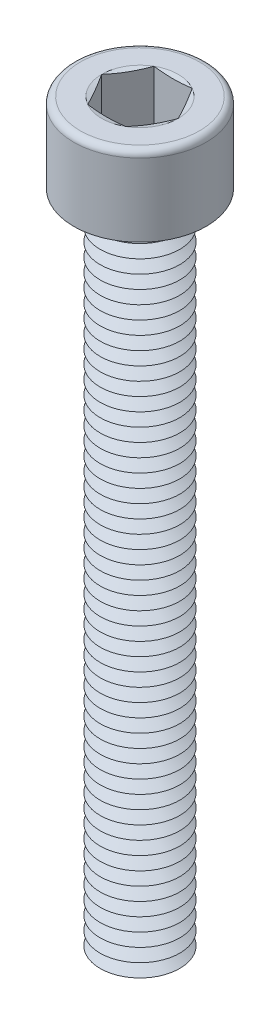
ISO-10303-21;
HEADER;
FILE_DESCRIPTION(('STEP AP214'),'2;1');
FILE_NAME('part.step','',(''),(''),'','','');
FILE_SCHEMA(('AUTOMOTIVE_DESIGN { 1 0 10303 214 1 1 1 1 }'));
ENDSEC;
DATA;
#1=APPLICATION_CONTEXT('core data for automotive mechanical design processes');
#2=APPLICATION_PROTOCOL_DEFINITION('international standard','automotive_design',2000,#1);
#3=PRODUCT_CONTEXT('',#1,'mechanical');
#4=PRODUCT('Part','Part','',(#3));
#5=PRODUCT_RELATED_PRODUCT_CATEGORY('part','',(#4));
#6=PRODUCT_DEFINITION_FORMATION('','',#4);
#7=PRODUCT_DEFINITION_CONTEXT('part definition',#1,'design');
#8=PRODUCT_DEFINITION('design','',#6,#7);
#9=PRODUCT_DEFINITION_SHAPE('','',#8);
#10=(LENGTH_UNIT() NAMED_UNIT(*) SI_UNIT(.MILLI.,.METRE.));
#11=(NAMED_UNIT(*) PLANE_ANGLE_UNIT() SI_UNIT($,.RADIAN.));
#12=(NAMED_UNIT(*) SI_UNIT($,.STERADIAN.) SOLID_ANGLE_UNIT());
#13=UNCERTAINTY_MEASURE_WITH_UNIT(LENGTH_MEASURE(1.E-05),#10,'distance_accuracy_value','');
#14=(GEOMETRIC_REPRESENTATION_CONTEXT(3) GLOBAL_UNCERTAINTY_ASSIGNED_CONTEXT((#13)) GLOBAL_UNIT_ASSIGNED_CONTEXT((#10,
#11,#12)) REPRESENTATION_CONTEXT('',''));
#15=CARTESIAN_POINT('',(0.,0.,0.));
#16=DIRECTION('',(0.,0.,1.));
#17=DIRECTION('',(1.,0.,0.));
#18=AXIS2_PLACEMENT_3D('',#15,#16,#17);
#19=CARTESIAN_POINT('',(0.,4.,0.));
#20=DIRECTION('',(0.,1.,0.));
#21=DIRECTION('',(0.,0.,1.));
#22=AXIS2_PLACEMENT_3D('',#19,#20,#21);
#23=CONICAL_SURFACE('',#22,2.13397459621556,1.0471975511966);
#24=CARTESIAN_POINT('',(0.,4.5,0.));
#25=DIRECTION('',(0.,1.,0.));
#26=DIRECTION('',(0.,0.,1.));
#27=AXIS2_PLACEMENT_3D('',#24,#25,#26);
#28=CIRCLE('',#27,3.);
#29=CARTESIAN_POINT('',(0.,4.5,3.));
#30=VERTEX_POINT('',#29);
#31=EDGE_CURVE('E711',#30,#30,#28,.T.);
#32=ORIENTED_EDGE('',*,*,#31,.F.);
#33=EDGE_LOOP('',(#32));
#34=FACE_BOUND('',#33,.T.);
#35=CARTESIAN_POINT('',(0.,4.,0.));
#36=DIRECTION('',(0.,1.,0.));
#37=DIRECTION('',(0.,0.,1.));
#38=AXIS2_PLACEMENT_3D('',#35,#36,#37);
#39=CIRCLE('',#38,2.13397459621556);
#40=CARTESIAN_POINT('',(0.,4.,2.13397459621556));
#41=VERTEX_POINT('',#40);
#42=EDGE_CURVE('E715',#41,#41,#39,.T.);
#43=ORIENTED_EDGE('',*,*,#42,.T.);
#44=EDGE_LOOP('',(#43));
#45=FACE_BOUND('',#44,.T.);
#46=ADVANCED_FACE('F41',(#34,#45),#23,.T.);
#47=CARTESIAN_POINT('',(0.,3.5,0.));
#48=DIRECTION('',(0.,-1.,0.));
#49=DIRECTION('',(0.,0.,-1.));
#50=AXIS2_PLACEMENT_3D('',#47,#48,#49);
#51=CONICAL_SURFACE('',#50,3.,1.0471975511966);
#52=ORIENTED_EDGE('',*,*,#42,.F.);
#53=EDGE_LOOP('',(#52));
#54=FACE_BOUND('',#53,.T.);
#55=CARTESIAN_POINT('',(0.,3.5,0.));
#56=DIRECTION('',(0.,1.,0.));
#57=DIRECTION('',(0.,0.,1.));
#58=AXIS2_PLACEMENT_3D('',#55,#56,#57);
#59=CIRCLE('',#58,3.);
#60=CARTESIAN_POINT('',(0.,3.5,3.));
#61=VERTEX_POINT('',#60);
#62=EDGE_CURVE('E719',#61,#61,#59,.T.);
#63=ORIENTED_EDGE('',*,*,#62,.T.);
#64=EDGE_LOOP('',(#63));
#65=FACE_BOUND('',#64,.T.);
#66=ADVANCED_FACE('F251',(#54,#65),#51,.T.);
#67=CARTESIAN_POINT('',(0.,0.,0.));
#68=DIRECTION('',(0.,1.,0.));
#69=DIRECTION('',(0.,0.,1.));
#70=AXIS2_PLACEMENT_3D('',#67,#68,#69);
#71=PLANE('',#70);
#72=CARTESIAN_POINT('',(0.,0.,0.));
#73=DIRECTION('',(0.,1.,0.));
#74=DIRECTION('',(0.,0.,1.));
#75=AXIS2_PLACEMENT_3D('',#72,#73,#74);
#76=CIRCLE('',#75,2.13397459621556);
#77=CARTESIAN_POINT('',(0.,0.,2.13397459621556));
#78=VERTEX_POINT('',#77);
#79=EDGE_CURVE('E747',#78,#78,#76,.T.);
#80=ORIENTED_EDGE('',*,*,#79,.F.);
#81=EDGE_LOOP('',(#80));
#82=FACE_BOUND('',#81,.T.);
#83=ADVANCED_FACE('F248',(#82),#71,.F.);
#84=CARTESIAN_POINT('',(0.,0.,0.));
#85=DIRECTION('',(0.,1.,0.));
#86=DIRECTION('',(0.,0.,1.));
#87=AXIS2_PLACEMENT_3D('',#84,#85,#86);
#88=CONICAL_SURFACE('',#87,2.13397459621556,1.0471975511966);
#89=CARTESIAN_POINT('',(0.,0.5,0.));
#90=DIRECTION('',(0.,1.,0.));
#91=DIRECTION('',(0.,0.,1.));
#92=AXIS2_PLACEMENT_3D('',#89,#90,#91);
#93=CIRCLE('',#92,3.);
#94=CARTESIAN_POINT('',(0.,0.5,3.));
#95=VERTEX_POINT('',#94);
#96=EDGE_CURVE('E743',#95,#95,#93,.T.);
#97=ORIENTED_EDGE('',*,*,#96,.F.);
#98=EDGE_LOOP('',(#97));
#99=FACE_BOUND('',#98,.T.);
#100=ORIENTED_EDGE('',*,*,#79,.T.);
#101=EDGE_LOOP('',(#100));
#102=FACE_BOUND('',#101,.T.);
#103=ADVANCED_FACE('F250',(#99,#102),#88,.T.);
#104=CARTESIAN_POINT('',(0.,0.5,0.));
#105=DIRECTION('',(0.,-1.,0.));
#106=DIRECTION('',(0.,0.,-1.));
#107=AXIS2_PLACEMENT_3D('',#104,#105,#106);
#108=CONICAL_SURFACE('',#107,3.,1.0471975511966);
#109=CARTESIAN_POINT('',(0.,1.,0.));
#110=DIRECTION('',(0.,1.,0.));
#111=DIRECTION('',(0.,0.,1.));
#112=AXIS2_PLACEMENT_3D('',#109,#110,#111);
#113=CIRCLE('',#112,2.13397459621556);
#114=CARTESIAN_POINT('',(0.,1.,2.13397459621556));
#115=VERTEX_POINT('',#114);
#116=EDGE_CURVE('E739',#115,#115,#113,.T.);
#117=ORIENTED_EDGE('',*,*,#116,.F.);
#118=EDGE_LOOP('',(#117));
#119=FACE_BOUND('',#118,.T.);
#120=ORIENTED_EDGE('',*,*,#96,.T.);
#121=EDGE_LOOP('',(#120));
#122=FACE_BOUND('',#121,.T.);
#123=ADVANCED_FACE('F291',(#119,#122),#108,.T.);
#124=CARTESIAN_POINT('',(0.,1.,0.));
#125=DIRECTION('',(0.,1.,0.));
#126=DIRECTION('',(0.,0.,1.));
#127=AXIS2_PLACEMENT_3D('',#124,#125,#126);
#128=CONICAL_SURFACE('',#127,2.13397459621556,1.0471975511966);
#129=CARTESIAN_POINT('',(0.,1.5,0.));
#130=DIRECTION('',(0.,1.,0.));
#131=DIRECTION('',(0.,0.,1.));
#132=AXIS2_PLACEMENT_3D('',#129,#130,#131);
#133=CIRCLE('',#132,3.);
#134=CARTESIAN_POINT('',(0.,1.5,3.));
#135=VERTEX_POINT('',#134);
#136=EDGE_CURVE('E735',#135,#135,#133,.T.);
#137=ORIENTED_EDGE('',*,*,#136,.F.);
#138=EDGE_LOOP('',(#137));
#139=FACE_BOUND('',#138,.T.);
#140=ORIENTED_EDGE('',*,*,#116,.T.);
#141=EDGE_LOOP('',(#140));
#142=FACE_BOUND('',#141,.T.);
#143=ADVANCED_FACE('F286',(#139,#142),#128,.T.);
#144=CARTESIAN_POINT('',(0.,1.5,0.));
#145=DIRECTION('',(0.,-1.,0.));
#146=DIRECTION('',(0.,0.,-1.));
#147=AXIS2_PLACEMENT_3D('',#144,#145,#146);
#148=CONICAL_SURFACE('',#147,3.,1.0471975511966);
#149=CARTESIAN_POINT('',(0.,2.,0.));
#150=DIRECTION('',(0.,1.,0.));
#151=DIRECTION('',(0.,0.,1.));
#152=AXIS2_PLACEMENT_3D('',#149,#150,#151);
#153=CIRCLE('',#152,2.13397459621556);
#154=CARTESIAN_POINT('',(0.,2.,2.13397459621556));
#155=VERTEX_POINT('',#154);
#156=EDGE_CURVE('E731',#155,#155,#153,.T.);
#157=ORIENTED_EDGE('',*,*,#156,.F.);
#158=EDGE_LOOP('',(#157));
#159=FACE_BOUND('',#158,.T.);
#160=ORIENTED_EDGE('',*,*,#136,.T.);
#161=EDGE_LOOP('',(#160));
#162=FACE_BOUND('',#161,.T.);
#163=ADVANCED_FACE('F283',(#159,#162),#148,.T.);
#164=CARTESIAN_POINT('',(0.,2.,0.));
#165=DIRECTION('',(0.,1.,0.));
#166=DIRECTION('',(0.,0.,1.));
#167=AXIS2_PLACEMENT_3D('',#164,#165,#166);
#168=CONICAL_SURFACE('',#167,2.13397459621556,1.0471975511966);
#169=CARTESIAN_POINT('',(0.,2.5,0.));
#170=DIRECTION('',(0.,1.,0.));
#171=DIRECTION('',(0.,0.,1.));
#172=AXIS2_PLACEMENT_3D('',#169,#170,#171);
#173=CIRCLE('',#172,3.);
#174=CARTESIAN_POINT('',(0.,2.5,3.));
#175=VERTEX_POINT('',#174);
#176=EDGE_CURVE('E727',#175,#175,#173,.T.);
#177=ORIENTED_EDGE('',*,*,#176,.F.);
#178=EDGE_LOOP('',(#177));
#179=FACE_BOUND('',#178,.T.);
#180=ORIENTED_EDGE('',*,*,#156,.T.);
#181=EDGE_LOOP('',(#180));
#182=FACE_BOUND('',#181,.T.);
#183=ADVANCED_FACE('F277',(#179,#182),#168,.T.);
#184=CARTESIAN_POINT('',(0.,2.5,0.));
#185=DIRECTION('',(0.,-1.,0.));
#186=DIRECTION('',(0.,0.,-1.));
#187=AXIS2_PLACEMENT_3D('',#184,#185,#186);
#188=CONICAL_SURFACE('',#187,3.,1.0471975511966);
#189=CARTESIAN_POINT('',(0.,3.,0.));
#190=DIRECTION('',(0.,1.,0.));
#191=DIRECTION('',(0.,0.,1.));
#192=AXIS2_PLACEMENT_3D('',#189,#190,#191);
#193=CIRCLE('',#192,2.13397459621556);
#194=CARTESIAN_POINT('',(0.,3.,2.13397459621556));
#195=VERTEX_POINT('',#194);
#196=EDGE_CURVE('E723',#195,#195,#193,.T.);
#197=ORIENTED_EDGE('',*,*,#196,.F.);
#198=EDGE_LOOP('',(#197));
#199=FACE_BOUND('',#198,.T.);
#200=ORIENTED_EDGE('',*,*,#176,.T.);
#201=EDGE_LOOP('',(#200));
#202=FACE_BOUND('',#201,.T.);
#203=ADVANCED_FACE('F273',(#199,#202),#188,.T.);
#204=CARTESIAN_POINT('',(0.,3.,0.));
#205=DIRECTION('',(0.,1.,0.));
#206=DIRECTION('',(0.,0.,1.));
#207=AXIS2_PLACEMENT_3D('',#204,#205,#206);
#208=CONICAL_SURFACE('',#207,2.13397459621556,1.0471975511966);
#209=ORIENTED_EDGE('',*,*,#62,.F.);
#210=EDGE_LOOP('',(#209));
#211=FACE_BOUND('',#210,.T.);
#212=ORIENTED_EDGE('',*,*,#196,.T.);
#213=EDGE_LOOP('',(#212));
#214=FACE_BOUND('',#213,.T.);
#215=ADVANCED_FACE('F276',(#211,#214),#208,.T.);
#216=CARTESIAN_POINT('',(0.,5.,0.));
#217=DIRECTION('',(0.,1.,0.));
#218=DIRECTION('',(0.,0.,1.));
#219=AXIS2_PLACEMENT_3D('',#216,#217,#218);
#220=CONICAL_SURFACE('',#219,2.13397459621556,1.0471975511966);
#221=CARTESIAN_POINT('',(0.,5.5,0.));
#222=DIRECTION('',(0.,1.,0.));
#223=DIRECTION('',(0.,0.,1.));
#224=AXIS2_PLACEMENT_3D('',#221,#222,#223);
#225=CIRCLE('',#224,3.);
#226=CARTESIAN_POINT('',(0.,5.5,3.));
#227=VERTEX_POINT('',#226);
#228=EDGE_CURVE('E703',#227,#227,#225,.T.);
#229=ORIENTED_EDGE('',*,*,#228,.F.);
#230=EDGE_LOOP('',(#229));
#231=FACE_BOUND('',#230,.T.);
#232=CARTESIAN_POINT('',(0.,5.,0.));
#233=DIRECTION('',(0.,1.,0.));
#234=DIRECTION('',(0.,0.,1.));
#235=AXIS2_PLACEMENT_3D('',#232,#233,#234);
#236=CIRCLE('',#235,2.13397459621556);
#237=CARTESIAN_POINT('',(0.,5.,2.13397459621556));
#238=VERTEX_POINT('',#237);
#239=EDGE_CURVE('E707',#238,#238,#236,.T.);
#240=ORIENTED_EDGE('',*,*,#239,.T.);
#241=EDGE_LOOP('',(#240));
#242=FACE_BOUND('',#241,.T.);
#243=ADVANCED_FACE('F281',(#231,#242),#220,.T.);
#244=CARTESIAN_POINT('',(0.,4.5,0.));
#245=DIRECTION('',(0.,-1.,0.));
#246=DIRECTION('',(0.,0.,-1.));
#247=AXIS2_PLACEMENT_3D('',#244,#245,#246);
#248=CONICAL_SURFACE('',#247,3.,1.0471975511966);
#249=ORIENTED_EDGE('',*,*,#239,.F.);
#250=EDGE_LOOP('',(#249));
#251=FACE_BOUND('',#250,.T.);
#252=ORIENTED_EDGE('',*,*,#31,.T.);
#253=EDGE_LOOP('',(#252));
#254=FACE_BOUND('',#253,.T.);
#255=ADVANCED_FACE('F979',(#251,#254),#248,.T.);
#256=CARTESIAN_POINT('',(0.,6.,0.));
#257=DIRECTION('',(0.,1.,0.));
#258=DIRECTION('',(0.,0.,1.));
#259=AXIS2_PLACEMENT_3D('',#256,#257,#258);
#260=CONICAL_SURFACE('',#259,2.13397459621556,1.0471975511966);
#261=CARTESIAN_POINT('',(0.,6.5,0.));
#262=DIRECTION('',(0.,1.,0.));
#263=DIRECTION('',(0.,0.,1.));
#264=AXIS2_PLACEMENT_3D('',#261,#262,#263);
#265=CIRCLE('',#264,3.);
#266=CARTESIAN_POINT('',(0.,6.5,3.));
#267=VERTEX_POINT('',#266);
#268=EDGE_CURVE('E695',#267,#267,#265,.T.);
#269=ORIENTED_EDGE('',*,*,#268,.F.);
#270=EDGE_LOOP('',(#269));
#271=FACE_BOUND('',#270,.T.);
#272=CARTESIAN_POINT('',(0.,6.,0.));
#273=DIRECTION('',(0.,1.,0.));
#274=DIRECTION('',(0.,0.,1.));
#275=AXIS2_PLACEMENT_3D('',#272,#273,#274);
#276=CIRCLE('',#275,2.13397459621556);
#277=CARTESIAN_POINT('',(0.,6.,2.13397459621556));
#278=VERTEX_POINT('',#277);
#279=EDGE_CURVE('E699',#278,#278,#276,.T.);
#280=ORIENTED_EDGE('',*,*,#279,.T.);
#281=EDGE_LOOP('',(#280));
#282=FACE_BOUND('',#281,.T.);
#283=ADVANCED_FACE('F988',(#271,#282),#260,.T.);
#284=CARTESIAN_POINT('',(0.,5.5,0.));
#285=DIRECTION('',(0.,-1.,0.));
#286=DIRECTION('',(0.,0.,-1.));
#287=AXIS2_PLACEMENT_3D('',#284,#285,#286);
#288=CONICAL_SURFACE('',#287,3.,1.0471975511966);
#289=ORIENTED_EDGE('',*,*,#279,.F.);
#290=EDGE_LOOP('',(#289));
#291=FACE_BOUND('',#290,.T.);
#292=ORIENTED_EDGE('',*,*,#228,.T.);
#293=EDGE_LOOP('',(#292));
#294=FACE_BOUND('',#293,.T.);
#295=ADVANCED_FACE('F998',(#291,#294),#288,.T.);
#296=CARTESIAN_POINT('',(0.,7.,0.));
#297=DIRECTION('',(0.,1.,0.));
#298=DIRECTION('',(0.,0.,1.));
#299=AXIS2_PLACEMENT_3D('',#296,#297,#298);
#300=CONICAL_SURFACE('',#299,2.13397459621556,1.0471975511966);
#301=CARTESIAN_POINT('',(0.,7.5,0.));
#302=DIRECTION('',(0.,1.,0.));
#303=DIRECTION('',(0.,0.,1.));
#304=AXIS2_PLACEMENT_3D('',#301,#302,#303);
#305=CIRCLE('',#304,3.);
#306=CARTESIAN_POINT('',(0.,7.5,3.));
#307=VERTEX_POINT('',#306);
#308=EDGE_CURVE('E687',#307,#307,#305,.T.);
#309=ORIENTED_EDGE('',*,*,#308,.F.);
#310=EDGE_LOOP('',(#309));
#311=FACE_BOUND('',#310,.T.);
#312=CARTESIAN_POINT('',(0.,7.,0.));
#313=DIRECTION('',(0.,1.,0.));
#314=DIRECTION('',(0.,0.,1.));
#315=AXIS2_PLACEMENT_3D('',#312,#313,#314);
#316=CIRCLE('',#315,2.13397459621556);
#317=CARTESIAN_POINT('',(0.,7.,2.13397459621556));
#318=VERTEX_POINT('',#317);
#319=EDGE_CURVE('E691',#318,#318,#316,.T.);
#320=ORIENTED_EDGE('',*,*,#319,.T.);
#321=EDGE_LOOP('',(#320));
#322=FACE_BOUND('',#321,.T.);
#323=ADVANCED_FACE('F1008',(#311,#322),#300,.T.);
#324=CARTESIAN_POINT('',(0.,6.5,0.));
#325=DIRECTION('',(0.,-1.,0.));
#326=DIRECTION('',(0.,0.,-1.));
#327=AXIS2_PLACEMENT_3D('',#324,#325,#326);
#328=CONICAL_SURFACE('',#327,3.,1.0471975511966);
#329=ORIENTED_EDGE('',*,*,#319,.F.);
#330=EDGE_LOOP('',(#329));
#331=FACE_BOUND('',#330,.T.);
#332=ORIENTED_EDGE('',*,*,#268,.T.);
#333=EDGE_LOOP('',(#332));
#334=FACE_BOUND('',#333,.T.);
#335=ADVANCED_FACE('F1018',(#331,#334),#328,.T.);
#336=CARTESIAN_POINT('',(0.,8.,0.));
#337=DIRECTION('',(0.,1.,0.));
#338=DIRECTION('',(0.,0.,1.));
#339=AXIS2_PLACEMENT_3D('',#336,#337,#338);
#340=CONICAL_SURFACE('',#339,2.13397459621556,1.0471975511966);
#341=CARTESIAN_POINT('',(0.,8.5,0.));
#342=DIRECTION('',(0.,1.,0.));
#343=DIRECTION('',(0.,0.,1.));
#344=AXIS2_PLACEMENT_3D('',#341,#342,#343);
#345=CIRCLE('',#344,3.);
#346=CARTESIAN_POINT('',(0.,8.5,3.));
#347=VERTEX_POINT('',#346);
#348=EDGE_CURVE('E679',#347,#347,#345,.T.);
#349=ORIENTED_EDGE('',*,*,#348,.F.);
#350=EDGE_LOOP('',(#349));
#351=FACE_BOUND('',#350,.T.);
#352=CARTESIAN_POINT('',(0.,8.,0.));
#353=DIRECTION('',(0.,1.,0.));
#354=DIRECTION('',(0.,0.,1.));
#355=AXIS2_PLACEMENT_3D('',#352,#353,#354);
#356=CIRCLE('',#355,2.13397459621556);
#357=CARTESIAN_POINT('',(0.,8.,2.13397459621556));
#358=VERTEX_POINT('',#357);
#359=EDGE_CURVE('E683',#358,#358,#356,.T.);
#360=ORIENTED_EDGE('',*,*,#359,.T.);
#361=EDGE_LOOP('',(#360));
#362=FACE_BOUND('',#361,.T.);
#363=ADVANCED_FACE('F1028',(#351,#362),#340,.T.);
#364=CARTESIAN_POINT('',(0.,7.5,0.));
#365=DIRECTION('',(0.,-1.,0.));
#366=DIRECTION('',(0.,0.,-1.));
#367=AXIS2_PLACEMENT_3D('',#364,#365,#366);
#368=CONICAL_SURFACE('',#367,3.,1.0471975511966);
#369=ORIENTED_EDGE('',*,*,#359,.F.);
#370=EDGE_LOOP('',(#369));
#371=FACE_BOUND('',#370,.T.);
#372=ORIENTED_EDGE('',*,*,#308,.T.);
#373=EDGE_LOOP('',(#372));
#374=FACE_BOUND('',#373,.T.);
#375=ADVANCED_FACE('F1038',(#371,#374),#368,.T.);
#376=CARTESIAN_POINT('',(0.,9.,0.));
#377=DIRECTION('',(0.,1.,0.));
#378=DIRECTION('',(0.,0.,1.));
#379=AXIS2_PLACEMENT_3D('',#376,#377,#378);
#380=CONICAL_SURFACE('',#379,2.13397459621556,1.0471975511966);
#381=CARTESIAN_POINT('',(0.,9.5,0.));
#382=DIRECTION('',(0.,1.,0.));
#383=DIRECTION('',(0.,0.,1.));
#384=AXIS2_PLACEMENT_3D('',#381,#382,#383);
#385=CIRCLE('',#384,3.);
#386=CARTESIAN_POINT('',(0.,9.5,3.));
#387=VERTEX_POINT('',#386);
#388=EDGE_CURVE('E671',#387,#387,#385,.T.);
#389=ORIENTED_EDGE('',*,*,#388,.F.);
#390=EDGE_LOOP('',(#389));
#391=FACE_BOUND('',#390,.T.);
#392=CARTESIAN_POINT('',(0.,9.,0.));
#393=DIRECTION('',(0.,1.,0.));
#394=DIRECTION('',(0.,0.,1.));
#395=AXIS2_PLACEMENT_3D('',#392,#393,#394);
#396=CIRCLE('',#395,2.13397459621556);
#397=CARTESIAN_POINT('',(0.,9.,2.13397459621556));
#398=VERTEX_POINT('',#397);
#399=EDGE_CURVE('E675',#398,#398,#396,.T.);
#400=ORIENTED_EDGE('',*,*,#399,.T.);
#401=EDGE_LOOP('',(#400));
#402=FACE_BOUND('',#401,.T.);
#403=ADVANCED_FACE('F1048',(#391,#402),#380,.T.);
#404=CARTESIAN_POINT('',(0.,8.5,0.));
#405=DIRECTION('',(0.,-1.,0.));
#406=DIRECTION('',(0.,0.,-1.));
#407=AXIS2_PLACEMENT_3D('',#404,#405,#406);
#408=CONICAL_SURFACE('',#407,3.,1.0471975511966);
#409=ORIENTED_EDGE('',*,*,#399,.F.);
#410=EDGE_LOOP('',(#409));
#411=FACE_BOUND('',#410,.T.);
#412=ORIENTED_EDGE('',*,*,#348,.T.);
#413=EDGE_LOOP('',(#412));
#414=FACE_BOUND('',#413,.T.);
#415=ADVANCED_FACE('F1058',(#411,#414),#408,.T.);
#416=CARTESIAN_POINT('',(0.,10.,0.));
#417=DIRECTION('',(0.,1.,0.));
#418=DIRECTION('',(0.,0.,1.));
#419=AXIS2_PLACEMENT_3D('',#416,#417,#418);
#420=CONICAL_SURFACE('',#419,2.13397459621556,1.0471975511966);
#421=CARTESIAN_POINT('',(0.,10.5,0.));
#422=DIRECTION('',(0.,1.,0.));
#423=DIRECTION('',(0.,0.,1.));
#424=AXIS2_PLACEMENT_3D('',#421,#422,#423);
#425=CIRCLE('',#424,3.);
#426=CARTESIAN_POINT('',(0.,10.5,3.));
#427=VERTEX_POINT('',#426);
#428=EDGE_CURVE('E663',#427,#427,#425,.T.);
#429=ORIENTED_EDGE('',*,*,#428,.F.);
#430=EDGE_LOOP('',(#429));
#431=FACE_BOUND('',#430,.T.);
#432=CARTESIAN_POINT('',(0.,10.,0.));
#433=DIRECTION('',(0.,1.,0.));
#434=DIRECTION('',(0.,0.,1.));
#435=AXIS2_PLACEMENT_3D('',#432,#433,#434);
#436=CIRCLE('',#435,2.13397459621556);
#437=CARTESIAN_POINT('',(0.,10.,2.13397459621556));
#438=VERTEX_POINT('',#437);
#439=EDGE_CURVE('E667',#438,#438,#436,.T.);
#440=ORIENTED_EDGE('',*,*,#439,.T.);
#441=EDGE_LOOP('',(#440));
#442=FACE_BOUND('',#441,.T.);
#443=ADVANCED_FACE('F1068',(#431,#442),#420,.T.);
#444=CARTESIAN_POINT('',(0.,9.5,0.));
#445=DIRECTION('',(0.,-1.,0.));
#446=DIRECTION('',(0.,0.,-1.));
#447=AXIS2_PLACEMENT_3D('',#444,#445,#446);
#448=CONICAL_SURFACE('',#447,3.,1.0471975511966);
#449=ORIENTED_EDGE('',*,*,#439,.F.);
#450=EDGE_LOOP('',(#449));
#451=FACE_BOUND('',#450,.T.);
#452=ORIENTED_EDGE('',*,*,#388,.T.);
#453=EDGE_LOOP('',(#452));
#454=FACE_BOUND('',#453,.T.);
#455=ADVANCED_FACE('F1078',(#451,#454),#448,.T.);
#456=CARTESIAN_POINT('',(0.,11.,0.));
#457=DIRECTION('',(0.,1.,0.));
#458=DIRECTION('',(0.,0.,1.));
#459=AXIS2_PLACEMENT_3D('',#456,#457,#458);
#460=CONICAL_SURFACE('',#459,2.13397459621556,1.0471975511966);
#461=CARTESIAN_POINT('',(0.,11.5,0.));
#462=DIRECTION('',(0.,1.,0.));
#463=DIRECTION('',(0.,0.,1.));
#464=AXIS2_PLACEMENT_3D('',#461,#462,#463);
#465=CIRCLE('',#464,3.);
#466=CARTESIAN_POINT('',(0.,11.5,3.));
#467=VERTEX_POINT('',#466);
#468=EDGE_CURVE('E655',#467,#467,#465,.T.);
#469=ORIENTED_EDGE('',*,*,#468,.F.);
#470=EDGE_LOOP('',(#469));
#471=FACE_BOUND('',#470,.T.);
#472=CARTESIAN_POINT('',(0.,11.,0.));
#473=DIRECTION('',(0.,1.,0.));
#474=DIRECTION('',(0.,0.,1.));
#475=AXIS2_PLACEMENT_3D('',#472,#473,#474);
#476=CIRCLE('',#475,2.13397459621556);
#477=CARTESIAN_POINT('',(0.,11.,2.13397459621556));
#478=VERTEX_POINT('',#477);
#479=EDGE_CURVE('E659',#478,#478,#476,.T.);
#480=ORIENTED_EDGE('',*,*,#479,.T.);
#481=EDGE_LOOP('',(#480));
#482=FACE_BOUND('',#481,.T.);
#483=ADVANCED_FACE('F1088',(#471,#482),#460,.T.);
#484=CARTESIAN_POINT('',(0.,10.5,0.));
#485=DIRECTION('',(0.,-1.,0.));
#486=DIRECTION('',(0.,0.,-1.));
#487=AXIS2_PLACEMENT_3D('',#484,#485,#486);
#488=CONICAL_SURFACE('',#487,3.,1.0471975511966);
#489=ORIENTED_EDGE('',*,*,#479,.F.);
#490=EDGE_LOOP('',(#489));
#491=FACE_BOUND('',#490,.T.);
#492=ORIENTED_EDGE('',*,*,#428,.T.);
#493=EDGE_LOOP('',(#492));
#494=FACE_BOUND('',#493,.T.);
#495=ADVANCED_FACE('F1098',(#491,#494),#488,.T.);
#496=CARTESIAN_POINT('',(0.,12.,0.));
#497=DIRECTION('',(0.,1.,0.));
#498=DIRECTION('',(0.,0.,1.));
#499=AXIS2_PLACEMENT_3D('',#496,#497,#498);
#500=CONICAL_SURFACE('',#499,2.13397459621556,1.0471975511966);
#501=CARTESIAN_POINT('',(0.,12.5,0.));
#502=DIRECTION('',(0.,1.,0.));
#503=DIRECTION('',(0.,0.,1.));
#504=AXIS2_PLACEMENT_3D('',#501,#502,#503);
#505=CIRCLE('',#504,3.);
#506=CARTESIAN_POINT('',(0.,12.5,3.));
#507=VERTEX_POINT('',#506);
#508=EDGE_CURVE('E647',#507,#507,#505,.T.);
#509=ORIENTED_EDGE('',*,*,#508,.F.);
#510=EDGE_LOOP('',(#509));
#511=FACE_BOUND('',#510,.T.);
#512=CARTESIAN_POINT('',(0.,12.,0.));
#513=DIRECTION('',(0.,1.,0.));
#514=DIRECTION('',(0.,0.,1.));
#515=AXIS2_PLACEMENT_3D('',#512,#513,#514);
#516=CIRCLE('',#515,2.13397459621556);
#517=CARTESIAN_POINT('',(0.,12.,2.13397459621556));
#518=VERTEX_POINT('',#517);
#519=EDGE_CURVE('E651',#518,#518,#516,.T.);
#520=ORIENTED_EDGE('',*,*,#519,.T.);
#521=EDGE_LOOP('',(#520));
#522=FACE_BOUND('',#521,.T.);
#523=ADVANCED_FACE('F1108',(#511,#522),#500,.T.);
#524=CARTESIAN_POINT('',(0.,11.5,0.));
#525=DIRECTION('',(0.,-1.,0.));
#526=DIRECTION('',(0.,0.,-1.));
#527=AXIS2_PLACEMENT_3D('',#524,#525,#526);
#528=CONICAL_SURFACE('',#527,3.,1.0471975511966);
#529=ORIENTED_EDGE('',*,*,#519,.F.);
#530=EDGE_LOOP('',(#529));
#531=FACE_BOUND('',#530,.T.);
#532=ORIENTED_EDGE('',*,*,#468,.T.);
#533=EDGE_LOOP('',(#532));
#534=FACE_BOUND('',#533,.T.);
#535=ADVANCED_FACE('F1118',(#531,#534),#528,.T.);
#536=CARTESIAN_POINT('',(0.,13.,0.));
#537=DIRECTION('',(0.,1.,0.));
#538=DIRECTION('',(0.,0.,1.));
#539=AXIS2_PLACEMENT_3D('',#536,#537,#538);
#540=CONICAL_SURFACE('',#539,2.13397459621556,1.0471975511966);
#541=CARTESIAN_POINT('',(0.,13.5,0.));
#542=DIRECTION('',(0.,1.,0.));
#543=DIRECTION('',(0.,0.,1.));
#544=AXIS2_PLACEMENT_3D('',#541,#542,#543);
#545=CIRCLE('',#544,3.);
#546=CARTESIAN_POINT('',(0.,13.5,3.));
#547=VERTEX_POINT('',#546);
#548=EDGE_CURVE('E639',#547,#547,#545,.T.);
#549=ORIENTED_EDGE('',*,*,#548,.F.);
#550=EDGE_LOOP('',(#549));
#551=FACE_BOUND('',#550,.T.);
#552=CARTESIAN_POINT('',(0.,13.,0.));
#553=DIRECTION('',(0.,1.,0.));
#554=DIRECTION('',(0.,0.,1.));
#555=AXIS2_PLACEMENT_3D('',#552,#553,#554);
#556=CIRCLE('',#555,2.13397459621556);
#557=CARTESIAN_POINT('',(0.,13.,2.13397459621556));
#558=VERTEX_POINT('',#557);
#559=EDGE_CURVE('E643',#558,#558,#556,.T.);
#560=ORIENTED_EDGE('',*,*,#559,.T.);
#561=EDGE_LOOP('',(#560));
#562=FACE_BOUND('',#561,.T.);
#563=ADVANCED_FACE('F1128',(#551,#562),#540,.T.);
#564=CARTESIAN_POINT('',(0.,12.5,0.));
#565=DIRECTION('',(0.,-1.,0.));
#566=DIRECTION('',(0.,0.,-1.));
#567=AXIS2_PLACEMENT_3D('',#564,#565,#566);
#568=CONICAL_SURFACE('',#567,3.,1.0471975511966);
#569=ORIENTED_EDGE('',*,*,#559,.F.);
#570=EDGE_LOOP('',(#569));
#571=FACE_BOUND('',#570,.T.);
#572=ORIENTED_EDGE('',*,*,#508,.T.);
#573=EDGE_LOOP('',(#572));
#574=FACE_BOUND('',#573,.T.);
#575=ADVANCED_FACE('F1138',(#571,#574),#568,.T.);
#576=CARTESIAN_POINT('',(0.,14.,0.));
#577=DIRECTION('',(0.,1.,0.));
#578=DIRECTION('',(0.,0.,1.));
#579=AXIS2_PLACEMENT_3D('',#576,#577,#578);
#580=CONICAL_SURFACE('',#579,2.13397459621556,1.0471975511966);
#581=CARTESIAN_POINT('',(0.,14.5,0.));
#582=DIRECTION('',(0.,1.,0.));
#583=DIRECTION('',(0.,0.,1.));
#584=AXIS2_PLACEMENT_3D('',#581,#582,#583);
#585=CIRCLE('',#584,3.);
#586=CARTESIAN_POINT('',(0.,14.5,3.));
#587=VERTEX_POINT('',#586);
#588=EDGE_CURVE('E631',#587,#587,#585,.T.);
#589=ORIENTED_EDGE('',*,*,#588,.F.);
#590=EDGE_LOOP('',(#589));
#591=FACE_BOUND('',#590,.T.);
#592=CARTESIAN_POINT('',(0.,14.,0.));
#593=DIRECTION('',(0.,1.,0.));
#594=DIRECTION('',(0.,0.,1.));
#595=AXIS2_PLACEMENT_3D('',#592,#593,#594);
#596=CIRCLE('',#595,2.13397459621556);
#597=CARTESIAN_POINT('',(0.,14.,2.13397459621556));
#598=VERTEX_POINT('',#597);
#599=EDGE_CURVE('E635',#598,#598,#596,.T.);
#600=ORIENTED_EDGE('',*,*,#599,.T.);
#601=EDGE_LOOP('',(#600));
#602=FACE_BOUND('',#601,.T.);
#603=ADVANCED_FACE('F1148',(#591,#602),#580,.T.);
#604=CARTESIAN_POINT('',(0.,13.5,0.));
#605=DIRECTION('',(0.,-1.,0.));
#606=DIRECTION('',(0.,0.,-1.));
#607=AXIS2_PLACEMENT_3D('',#604,#605,#606);
#608=CONICAL_SURFACE('',#607,3.,1.0471975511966);
#609=ORIENTED_EDGE('',*,*,#599,.F.);
#610=EDGE_LOOP('',(#609));
#611=FACE_BOUND('',#610,.T.);
#612=ORIENTED_EDGE('',*,*,#548,.T.);
#613=EDGE_LOOP('',(#612));
#614=FACE_BOUND('',#613,.T.);
#615=ADVANCED_FACE('F1158',(#611,#614),#608,.T.);
#616=CARTESIAN_POINT('',(0.,15.,0.));
#617=DIRECTION('',(0.,1.,0.));
#618=DIRECTION('',(0.,0.,1.));
#619=AXIS2_PLACEMENT_3D('',#616,#617,#618);
#620=CONICAL_SURFACE('',#619,2.13397459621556,1.0471975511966);
#621=CARTESIAN_POINT('',(0.,15.5,0.));
#622=DIRECTION('',(0.,1.,0.));
#623=DIRECTION('',(0.,0.,1.));
#624=AXIS2_PLACEMENT_3D('',#621,#622,#623);
#625=CIRCLE('',#624,3.);
#626=CARTESIAN_POINT('',(0.,15.5,3.));
#627=VERTEX_POINT('',#626);
#628=EDGE_CURVE('E623',#627,#627,#625,.T.);
#629=ORIENTED_EDGE('',*,*,#628,.F.);
#630=EDGE_LOOP('',(#629));
#631=FACE_BOUND('',#630,.T.);
#632=CARTESIAN_POINT('',(0.,15.,0.));
#633=DIRECTION('',(0.,1.,0.));
#634=DIRECTION('',(0.,0.,1.));
#635=AXIS2_PLACEMENT_3D('',#632,#633,#634);
#636=CIRCLE('',#635,2.13397459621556);
#637=CARTESIAN_POINT('',(0.,15.,2.13397459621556));
#638=VERTEX_POINT('',#637);
#639=EDGE_CURVE('E627',#638,#638,#636,.T.);
#640=ORIENTED_EDGE('',*,*,#639,.T.);
#641=EDGE_LOOP('',(#640));
#642=FACE_BOUND('',#641,.T.);
#643=ADVANCED_FACE('F1168',(#631,#642),#620,.T.);
#644=CARTESIAN_POINT('',(0.,14.5,0.));
#645=DIRECTION('',(0.,-1.,0.));
#646=DIRECTION('',(0.,0.,-1.));
#647=AXIS2_PLACEMENT_3D('',#644,#645,#646);
#648=CONICAL_SURFACE('',#647,3.,1.0471975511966);
#649=ORIENTED_EDGE('',*,*,#639,.F.);
#650=EDGE_LOOP('',(#649));
#651=FACE_BOUND('',#650,.T.);
#652=ORIENTED_EDGE('',*,*,#588,.T.);
#653=EDGE_LOOP('',(#652));
#654=FACE_BOUND('',#653,.T.);
#655=ADVANCED_FACE('F1178',(#651,#654),#648,.T.);
#656=CARTESIAN_POINT('',(0.,16.,0.));
#657=DIRECTION('',(0.,1.,0.));
#658=DIRECTION('',(0.,0.,1.));
#659=AXIS2_PLACEMENT_3D('',#656,#657,#658);
#660=CONICAL_SURFACE('',#659,2.13397459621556,1.0471975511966);
#661=CARTESIAN_POINT('',(0.,16.5,0.));
#662=DIRECTION('',(0.,1.,0.));
#663=DIRECTION('',(0.,0.,1.));
#664=AXIS2_PLACEMENT_3D('',#661,#662,#663);
#665=CIRCLE('',#664,3.);
#666=CARTESIAN_POINT('',(0.,16.5,3.));
#667=VERTEX_POINT('',#666);
#668=EDGE_CURVE('E615',#667,#667,#665,.T.);
#669=ORIENTED_EDGE('',*,*,#668,.F.);
#670=EDGE_LOOP('',(#669));
#671=FACE_BOUND('',#670,.T.);
#672=CARTESIAN_POINT('',(0.,16.,0.));
#673=DIRECTION('',(0.,1.,0.));
#674=DIRECTION('',(0.,0.,1.));
#675=AXIS2_PLACEMENT_3D('',#672,#673,#674);
#676=CIRCLE('',#675,2.13397459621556);
#677=CARTESIAN_POINT('',(0.,16.,2.13397459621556));
#678=VERTEX_POINT('',#677);
#679=EDGE_CURVE('E619',#678,#678,#676,.T.);
#680=ORIENTED_EDGE('',*,*,#679,.T.);
#681=EDGE_LOOP('',(#680));
#682=FACE_BOUND('',#681,.T.);
#683=ADVANCED_FACE('F1188',(#671,#682),#660,.T.);
#684=CARTESIAN_POINT('',(0.,15.5,0.));
#685=DIRECTION('',(0.,-1.,0.));
#686=DIRECTION('',(0.,0.,-1.));
#687=AXIS2_PLACEMENT_3D('',#684,#685,#686);
#688=CONICAL_SURFACE('',#687,3.,1.0471975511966);
#689=ORIENTED_EDGE('',*,*,#679,.F.);
#690=EDGE_LOOP('',(#689));
#691=FACE_BOUND('',#690,.T.);
#692=ORIENTED_EDGE('',*,*,#628,.T.);
#693=EDGE_LOOP('',(#692));
#694=FACE_BOUND('',#693,.T.);
#695=ADVANCED_FACE('F1198',(#691,#694),#688,.T.);
#696=CARTESIAN_POINT('',(0.,17.,0.));
#697=DIRECTION('',(0.,1.,0.));
#698=DIRECTION('',(0.,0.,1.));
#699=AXIS2_PLACEMENT_3D('',#696,#697,#698);
#700=CONICAL_SURFACE('',#699,2.13397459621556,1.0471975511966);
#701=CARTESIAN_POINT('',(0.,17.5,0.));
#702=DIRECTION('',(0.,1.,0.));
#703=DIRECTION('',(0.,0.,1.));
#704=AXIS2_PLACEMENT_3D('',#701,#702,#703);
#705=CIRCLE('',#704,3.);
#706=CARTESIAN_POINT('',(0.,17.5,3.));
#707=VERTEX_POINT('',#706);
#708=EDGE_CURVE('E607',#707,#707,#705,.T.);
#709=ORIENTED_EDGE('',*,*,#708,.F.);
#710=EDGE_LOOP('',(#709));
#711=FACE_BOUND('',#710,.T.);
#712=CARTESIAN_POINT('',(0.,17.,0.));
#713=DIRECTION('',(0.,1.,0.));
#714=DIRECTION('',(0.,0.,1.));
#715=AXIS2_PLACEMENT_3D('',#712,#713,#714);
#716=CIRCLE('',#715,2.13397459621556);
#717=CARTESIAN_POINT('',(0.,17.,2.13397459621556));
#718=VERTEX_POINT('',#717);
#719=EDGE_CURVE('E611',#718,#718,#716,.T.);
#720=ORIENTED_EDGE('',*,*,#719,.T.);
#721=EDGE_LOOP('',(#720));
#722=FACE_BOUND('',#721,.T.);
#723=ADVANCED_FACE('F1208',(#711,#722),#700,.T.);
#724=CARTESIAN_POINT('',(0.,16.5,0.));
#725=DIRECTION('',(0.,-1.,0.));
#726=DIRECTION('',(0.,0.,-1.));
#727=AXIS2_PLACEMENT_3D('',#724,#725,#726);
#728=CONICAL_SURFACE('',#727,3.,1.0471975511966);
#729=ORIENTED_EDGE('',*,*,#719,.F.);
#730=EDGE_LOOP('',(#729));
#731=FACE_BOUND('',#730,.T.);
#732=ORIENTED_EDGE('',*,*,#668,.T.);
#733=EDGE_LOOP('',(#732));
#734=FACE_BOUND('',#733,.T.);
#735=ADVANCED_FACE('F1218',(#731,#734),#728,.T.);
#736=CARTESIAN_POINT('',(0.,18.,0.));
#737=DIRECTION('',(0.,1.,0.));
#738=DIRECTION('',(0.,0.,1.));
#739=AXIS2_PLACEMENT_3D('',#736,#737,#738);
#740=CONICAL_SURFACE('',#739,2.13397459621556,1.0471975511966);
#741=CARTESIAN_POINT('',(0.,18.5,0.));
#742=DIRECTION('',(0.,1.,0.));
#743=DIRECTION('',(0.,0.,1.));
#744=AXIS2_PLACEMENT_3D('',#741,#742,#743);
#745=CIRCLE('',#744,3.);
#746=CARTESIAN_POINT('',(0.,18.5,3.));
#747=VERTEX_POINT('',#746);
#748=EDGE_CURVE('E599',#747,#747,#745,.T.);
#749=ORIENTED_EDGE('',*,*,#748,.F.);
#750=EDGE_LOOP('',(#749));
#751=FACE_BOUND('',#750,.T.);
#752=CARTESIAN_POINT('',(0.,18.,0.));
#753=DIRECTION('',(0.,1.,0.));
#754=DIRECTION('',(0.,0.,1.));
#755=AXIS2_PLACEMENT_3D('',#752,#753,#754);
#756=CIRCLE('',#755,2.13397459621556);
#757=CARTESIAN_POINT('',(0.,18.,2.13397459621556));
#758=VERTEX_POINT('',#757);
#759=EDGE_CURVE('E603',#758,#758,#756,.T.);
#760=ORIENTED_EDGE('',*,*,#759,.T.);
#761=EDGE_LOOP('',(#760));
#762=FACE_BOUND('',#761,.T.);
#763=ADVANCED_FACE('F1228',(#751,#762),#740,.T.);
#764=CARTESIAN_POINT('',(0.,17.5,0.));
#765=DIRECTION('',(0.,-1.,0.));
#766=DIRECTION('',(0.,0.,-1.));
#767=AXIS2_PLACEMENT_3D('',#764,#765,#766);
#768=CONICAL_SURFACE('',#767,3.,1.0471975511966);
#769=ORIENTED_EDGE('',*,*,#759,.F.);
#770=EDGE_LOOP('',(#769));
#771=FACE_BOUND('',#770,.T.);
#772=ORIENTED_EDGE('',*,*,#708,.T.);
#773=EDGE_LOOP('',(#772));
#774=FACE_BOUND('',#773,.T.);
#775=ADVANCED_FACE('F1238',(#771,#774),#768,.T.);
#776=CARTESIAN_POINT('',(0.,19.,0.));
#777=DIRECTION('',(0.,1.,0.));
#778=DIRECTION('',(0.,0.,1.));
#779=AXIS2_PLACEMENT_3D('',#776,#777,#778);
#780=CONICAL_SURFACE('',#779,2.13397459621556,1.0471975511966);
#781=CARTESIAN_POINT('',(0.,19.5,0.));
#782=DIRECTION('',(0.,1.,0.));
#783=DIRECTION('',(0.,0.,1.));
#784=AXIS2_PLACEMENT_3D('',#781,#782,#783);
#785=CIRCLE('',#784,3.);
#786=CARTESIAN_POINT('',(0.,19.5,3.));
#787=VERTEX_POINT('',#786);
#788=EDGE_CURVE('E591',#787,#787,#785,.T.);
#789=ORIENTED_EDGE('',*,*,#788,.F.);
#790=EDGE_LOOP('',(#789));
#791=FACE_BOUND('',#790,.T.);
#792=CARTESIAN_POINT('',(0.,19.,0.));
#793=DIRECTION('',(0.,1.,0.));
#794=DIRECTION('',(0.,0.,1.));
#795=AXIS2_PLACEMENT_3D('',#792,#793,#794);
#796=CIRCLE('',#795,2.13397459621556);
#797=CARTESIAN_POINT('',(0.,19.,2.13397459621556));
#798=VERTEX_POINT('',#797);
#799=EDGE_CURVE('E595',#798,#798,#796,.T.);
#800=ORIENTED_EDGE('',*,*,#799,.T.);
#801=EDGE_LOOP('',(#800));
#802=FACE_BOUND('',#801,.T.);
#803=ADVANCED_FACE('F1248',(#791,#802),#780,.T.);
#804=CARTESIAN_POINT('',(0.,18.5,0.));
#805=DIRECTION('',(0.,-1.,0.));
#806=DIRECTION('',(0.,0.,-1.));
#807=AXIS2_PLACEMENT_3D('',#804,#805,#806);
#808=CONICAL_SURFACE('',#807,3.,1.0471975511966);
#809=ORIENTED_EDGE('',*,*,#799,.F.);
#810=EDGE_LOOP('',(#809));
#811=FACE_BOUND('',#810,.T.);
#812=ORIENTED_EDGE('',*,*,#748,.T.);
#813=EDGE_LOOP('',(#812));
#814=FACE_BOUND('',#813,.T.);
#815=ADVANCED_FACE('F1258',(#811,#814),#808,.T.);
#816=CARTESIAN_POINT('',(0.,20.,0.));
#817=DIRECTION('',(0.,1.,0.));
#818=DIRECTION('',(0.,0.,1.));
#819=AXIS2_PLACEMENT_3D('',#816,#817,#818);
#820=CONICAL_SURFACE('',#819,2.13397459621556,1.0471975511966);
#821=CARTESIAN_POINT('',(0.,20.5,0.));
#822=DIRECTION('',(0.,1.,0.));
#823=DIRECTION('',(0.,0.,1.));
#824=AXIS2_PLACEMENT_3D('',#821,#822,#823);
#825=CIRCLE('',#824,3.);
#826=CARTESIAN_POINT('',(0.,20.5,3.));
#827=VERTEX_POINT('',#826);
#828=EDGE_CURVE('E583',#827,#827,#825,.T.);
#829=ORIENTED_EDGE('',*,*,#828,.F.);
#830=EDGE_LOOP('',(#829));
#831=FACE_BOUND('',#830,.T.);
#832=CARTESIAN_POINT('',(0.,20.,0.));
#833=DIRECTION('',(0.,1.,0.));
#834=DIRECTION('',(0.,0.,1.));
#835=AXIS2_PLACEMENT_3D('',#832,#833,#834);
#836=CIRCLE('',#835,2.13397459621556);
#837=CARTESIAN_POINT('',(0.,20.,2.13397459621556));
#838=VERTEX_POINT('',#837);
#839=EDGE_CURVE('E587',#838,#838,#836,.T.);
#840=ORIENTED_EDGE('',*,*,#839,.T.);
#841=EDGE_LOOP('',(#840));
#842=FACE_BOUND('',#841,.T.);
#843=ADVANCED_FACE('F1268',(#831,#842),#820,.T.);
#844=CARTESIAN_POINT('',(0.,19.5,0.));
#845=DIRECTION('',(0.,-1.,0.));
#846=DIRECTION('',(0.,0.,-1.));
#847=AXIS2_PLACEMENT_3D('',#844,#845,#846);
#848=CONICAL_SURFACE('',#847,3.,1.0471975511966);
#849=ORIENTED_EDGE('',*,*,#839,.F.);
#850=EDGE_LOOP('',(#849));
#851=FACE_BOUND('',#850,.T.);
#852=ORIENTED_EDGE('',*,*,#788,.T.);
#853=EDGE_LOOP('',(#852));
#854=FACE_BOUND('',#853,.T.);
#855=ADVANCED_FACE('F1278',(#851,#854),#848,.T.);
#856=CARTESIAN_POINT('',(0.,21.,0.));
#857=DIRECTION('',(0.,1.,0.));
#858=DIRECTION('',(0.,0.,1.));
#859=AXIS2_PLACEMENT_3D('',#856,#857,#858);
#860=CONICAL_SURFACE('',#859,2.13397459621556,1.0471975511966);
#861=CARTESIAN_POINT('',(0.,21.5,0.));
#862=DIRECTION('',(0.,1.,0.));
#863=DIRECTION('',(0.,0.,1.));
#864=AXIS2_PLACEMENT_3D('',#861,#862,#863);
#865=CIRCLE('',#864,3.);
#866=CARTESIAN_POINT('',(0.,21.5,3.));
#867=VERTEX_POINT('',#866);
#868=EDGE_CURVE('E575',#867,#867,#865,.T.);
#869=ORIENTED_EDGE('',*,*,#868,.F.);
#870=EDGE_LOOP('',(#869));
#871=FACE_BOUND('',#870,.T.);
#872=CARTESIAN_POINT('',(0.,21.,0.));
#873=DIRECTION('',(0.,1.,0.));
#874=DIRECTION('',(0.,0.,1.));
#875=AXIS2_PLACEMENT_3D('',#872,#873,#874);
#876=CIRCLE('',#875,2.13397459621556);
#877=CARTESIAN_POINT('',(0.,21.,2.13397459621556));
#878=VERTEX_POINT('',#877);
#879=EDGE_CURVE('E579',#878,#878,#876,.T.);
#880=ORIENTED_EDGE('',*,*,#879,.T.);
#881=EDGE_LOOP('',(#880));
#882=FACE_BOUND('',#881,.T.);
#883=ADVANCED_FACE('F1288',(#871,#882),#860,.T.);
#884=CARTESIAN_POINT('',(0.,20.5,0.));
#885=DIRECTION('',(0.,-1.,0.));
#886=DIRECTION('',(0.,0.,-1.));
#887=AXIS2_PLACEMENT_3D('',#884,#885,#886);
#888=CONICAL_SURFACE('',#887,3.,1.0471975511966);
#889=ORIENTED_EDGE('',*,*,#879,.F.);
#890=EDGE_LOOP('',(#889));
#891=FACE_BOUND('',#890,.T.);
#892=ORIENTED_EDGE('',*,*,#828,.T.);
#893=EDGE_LOOP('',(#892));
#894=FACE_BOUND('',#893,.T.);
#895=ADVANCED_FACE('F1298',(#891,#894),#888,.T.);
#896=CARTESIAN_POINT('',(0.,22.,0.));
#897=DIRECTION('',(0.,1.,0.));
#898=DIRECTION('',(0.,0.,1.));
#899=AXIS2_PLACEMENT_3D('',#896,#897,#898);
#900=CONICAL_SURFACE('',#899,2.13397459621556,1.0471975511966);
#901=CARTESIAN_POINT('',(0.,22.5,0.));
#902=DIRECTION('',(0.,1.,0.));
#903=DIRECTION('',(0.,0.,1.));
#904=AXIS2_PLACEMENT_3D('',#901,#902,#903);
#905=CIRCLE('',#904,3.);
#906=CARTESIAN_POINT('',(0.,22.5,3.));
#907=VERTEX_POINT('',#906);
#908=EDGE_CURVE('E567',#907,#907,#905,.T.);
#909=ORIENTED_EDGE('',*,*,#908,.F.);
#910=EDGE_LOOP('',(#909));
#911=FACE_BOUND('',#910,.T.);
#912=CARTESIAN_POINT('',(0.,22.,0.));
#913=DIRECTION('',(0.,1.,0.));
#914=DIRECTION('',(0.,0.,1.));
#915=AXIS2_PLACEMENT_3D('',#912,#913,#914);
#916=CIRCLE('',#915,2.13397459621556);
#917=CARTESIAN_POINT('',(0.,22.,2.13397459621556));
#918=VERTEX_POINT('',#917);
#919=EDGE_CURVE('E571',#918,#918,#916,.T.);
#920=ORIENTED_EDGE('',*,*,#919,.T.);
#921=EDGE_LOOP('',(#920));
#922=FACE_BOUND('',#921,.T.);
#923=ADVANCED_FACE('F1308',(#911,#922),#900,.T.);
#924=CARTESIAN_POINT('',(0.,21.5,0.));
#925=DIRECTION('',(0.,-1.,0.));
#926=DIRECTION('',(0.,0.,-1.));
#927=AXIS2_PLACEMENT_3D('',#924,#925,#926);
#928=CONICAL_SURFACE('',#927,3.,1.0471975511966);
#929=ORIENTED_EDGE('',*,*,#919,.F.);
#930=EDGE_LOOP('',(#929));
#931=FACE_BOUND('',#930,.T.);
#932=ORIENTED_EDGE('',*,*,#868,.T.);
#933=EDGE_LOOP('',(#932));
#934=FACE_BOUND('',#933,.T.);
#935=ADVANCED_FACE('F1318',(#931,#934),#928,.T.);
#936=CARTESIAN_POINT('',(0.,23.,0.));
#937=DIRECTION('',(0.,1.,0.));
#938=DIRECTION('',(0.,0.,1.));
#939=AXIS2_PLACEMENT_3D('',#936,#937,#938);
#940=CONICAL_SURFACE('',#939,2.13397459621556,1.0471975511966);
#941=CARTESIAN_POINT('',(0.,23.5,0.));
#942=DIRECTION('',(0.,1.,0.));
#943=DIRECTION('',(0.,0.,1.));
#944=AXIS2_PLACEMENT_3D('',#941,#942,#943);
#945=CIRCLE('',#944,3.);
#946=CARTESIAN_POINT('',(0.,23.5,3.));
#947=VERTEX_POINT('',#946);
#948=EDGE_CURVE('E559',#947,#947,#945,.T.);
#949=ORIENTED_EDGE('',*,*,#948,.F.);
#950=EDGE_LOOP('',(#949));
#951=FACE_BOUND('',#950,.T.);
#952=CARTESIAN_POINT('',(0.,23.,0.));
#953=DIRECTION('',(0.,1.,0.));
#954=DIRECTION('',(0.,0.,1.));
#955=AXIS2_PLACEMENT_3D('',#952,#953,#954);
#956=CIRCLE('',#955,2.13397459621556);
#957=CARTESIAN_POINT('',(0.,23.,2.13397459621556));
#958=VERTEX_POINT('',#957);
#959=EDGE_CURVE('E563',#958,#958,#956,.T.);
#960=ORIENTED_EDGE('',*,*,#959,.T.);
#961=EDGE_LOOP('',(#960));
#962=FACE_BOUND('',#961,.T.);
#963=ADVANCED_FACE('F1328',(#951,#962),#940,.T.);
#964=CARTESIAN_POINT('',(0.,22.5,0.));
#965=DIRECTION('',(0.,-1.,0.));
#966=DIRECTION('',(0.,0.,-1.));
#967=AXIS2_PLACEMENT_3D('',#964,#965,#966);
#968=CONICAL_SURFACE('',#967,3.,1.0471975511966);
#969=ORIENTED_EDGE('',*,*,#959,.F.);
#970=EDGE_LOOP('',(#969));
#971=FACE_BOUND('',#970,.T.);
#972=ORIENTED_EDGE('',*,*,#908,.T.);
#973=EDGE_LOOP('',(#972));
#974=FACE_BOUND('',#973,.T.);
#975=ADVANCED_FACE('F1338',(#971,#974),#968,.T.);
#976=CARTESIAN_POINT('',(0.,24.,0.));
#977=DIRECTION('',(0.,1.,0.));
#978=DIRECTION('',(0.,0.,1.));
#979=AXIS2_PLACEMENT_3D('',#976,#977,#978);
#980=CONICAL_SURFACE('',#979,2.13397459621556,1.0471975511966);
#981=CARTESIAN_POINT('',(0.,24.5,0.));
#982=DIRECTION('',(0.,1.,0.));
#983=DIRECTION('',(0.,0.,1.));
#984=AXIS2_PLACEMENT_3D('',#981,#982,#983);
#985=CIRCLE('',#984,3.);
#986=CARTESIAN_POINT('',(0.,24.5,3.));
#987=VERTEX_POINT('',#986);
#988=EDGE_CURVE('E551',#987,#987,#985,.T.);
#989=ORIENTED_EDGE('',*,*,#988,.F.);
#990=EDGE_LOOP('',(#989));
#991=FACE_BOUND('',#990,.T.);
#992=CARTESIAN_POINT('',(0.,24.,0.));
#993=DIRECTION('',(0.,1.,0.));
#994=DIRECTION('',(0.,0.,1.));
#995=AXIS2_PLACEMENT_3D('',#992,#993,#994);
#996=CIRCLE('',#995,2.13397459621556);
#997=CARTESIAN_POINT('',(0.,24.,2.13397459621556));
#998=VERTEX_POINT('',#997);
#999=EDGE_CURVE('E555',#998,#998,#996,.T.);
#1000=ORIENTED_EDGE('',*,*,#999,.T.);
#1001=EDGE_LOOP('',(#1000));
#1002=FACE_BOUND('',#1001,.T.);
#1003=ADVANCED_FACE('F1348',(#991,#1002),#980,.T.);
#1004=CARTESIAN_POINT('',(0.,23.5,0.));
#1005=DIRECTION('',(0.,-1.,0.));
#1006=DIRECTION('',(0.,0.,-1.));
#1007=AXIS2_PLACEMENT_3D('',#1004,#1005,#1006);
#1008=CONICAL_SURFACE('',#1007,3.,1.0471975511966);
#1009=ORIENTED_EDGE('',*,*,#999,.F.);
#1010=EDGE_LOOP('',(#1009));
#1011=FACE_BOUND('',#1010,.T.);
#1012=ORIENTED_EDGE('',*,*,#948,.T.);
#1013=EDGE_LOOP('',(#1012));
#1014=FACE_BOUND('',#1013,.T.);
#1015=ADVANCED_FACE('F1358',(#1011,#1014),#1008,.T.);
#1016=CARTESIAN_POINT('',(0.,25.,0.));
#1017=DIRECTION('',(0.,1.,0.));
#1018=DIRECTION('',(0.,0.,1.));
#1019=AXIS2_PLACEMENT_3D('',#1016,#1017,#1018);
#1020=CONICAL_SURFACE('',#1019,2.13397459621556,1.0471975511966);
#1021=CARTESIAN_POINT('',(0.,25.5,0.));
#1022=DIRECTION('',(0.,1.,0.));
#1023=DIRECTION('',(0.,0.,1.));
#1024=AXIS2_PLACEMENT_3D('',#1021,#1022,#1023);
#1025=CIRCLE('',#1024,3.);
#1026=CARTESIAN_POINT('',(0.,25.5,3.));
#1027=VERTEX_POINT('',#1026);
#1028=EDGE_CURVE('E543',#1027,#1027,#1025,.T.);
#1029=ORIENTED_EDGE('',*,*,#1028,.F.);
#1030=EDGE_LOOP('',(#1029));
#1031=FACE_BOUND('',#1030,.T.);
#1032=CARTESIAN_POINT('',(0.,25.,0.));
#1033=DIRECTION('',(0.,1.,0.));
#1034=DIRECTION('',(0.,0.,1.));
#1035=AXIS2_PLACEMENT_3D('',#1032,#1033,#1034);
#1036=CIRCLE('',#1035,2.13397459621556);
#1037=CARTESIAN_POINT('',(0.,25.,2.13397459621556));
#1038=VERTEX_POINT('',#1037);
#1039=EDGE_CURVE('E547',#1038,#1038,#1036,.T.);
#1040=ORIENTED_EDGE('',*,*,#1039,.T.);
#1041=EDGE_LOOP('',(#1040));
#1042=FACE_BOUND('',#1041,.T.);
#1043=ADVANCED_FACE('F1368',(#1031,#1042),#1020,.T.);
#1044=CARTESIAN_POINT('',(0.,24.5,0.));
#1045=DIRECTION('',(0.,-1.,0.));
#1046=DIRECTION('',(0.,0.,-1.));
#1047=AXIS2_PLACEMENT_3D('',#1044,#1045,#1046);
#1048=CONICAL_SURFACE('',#1047,3.,1.0471975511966);
#1049=ORIENTED_EDGE('',*,*,#1039,.F.);
#1050=EDGE_LOOP('',(#1049));
#1051=FACE_BOUND('',#1050,.T.);
#1052=ORIENTED_EDGE('',*,*,#988,.T.);
#1053=EDGE_LOOP('',(#1052));
#1054=FACE_BOUND('',#1053,.T.);
#1055=ADVANCED_FACE('F1378',(#1051,#1054),#1048,.T.);
#1056=CARTESIAN_POINT('',(0.,26.,0.));
#1057=DIRECTION('',(0.,1.,0.));
#1058=DIRECTION('',(0.,0.,1.));
#1059=AXIS2_PLACEMENT_3D('',#1056,#1057,#1058);
#1060=CONICAL_SURFACE('',#1059,2.13397459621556,1.0471975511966);
#1061=CARTESIAN_POINT('',(0.,26.5,0.));
#1062=DIRECTION('',(0.,1.,0.));
#1063=DIRECTION('',(0.,0.,1.));
#1064=AXIS2_PLACEMENT_3D('',#1061,#1062,#1063);
#1065=CIRCLE('',#1064,3.);
#1066=CARTESIAN_POINT('',(0.,26.5,3.));
#1067=VERTEX_POINT('',#1066);
#1068=EDGE_CURVE('E535',#1067,#1067,#1065,.T.);
#1069=ORIENTED_EDGE('',*,*,#1068,.F.);
#1070=EDGE_LOOP('',(#1069));
#1071=FACE_BOUND('',#1070,.T.);
#1072=CARTESIAN_POINT('',(0.,26.,0.));
#1073=DIRECTION('',(0.,1.,0.));
#1074=DIRECTION('',(0.,0.,1.));
#1075=AXIS2_PLACEMENT_3D('',#1072,#1073,#1074);
#1076=CIRCLE('',#1075,2.13397459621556);
#1077=CARTESIAN_POINT('',(0.,26.,2.13397459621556));
#1078=VERTEX_POINT('',#1077);
#1079=EDGE_CURVE('E539',#1078,#1078,#1076,.T.);
#1080=ORIENTED_EDGE('',*,*,#1079,.T.);
#1081=EDGE_LOOP('',(#1080));
#1082=FACE_BOUND('',#1081,.T.);
#1083=ADVANCED_FACE('F1388',(#1071,#1082),#1060,.T.);
#1084=CARTESIAN_POINT('',(0.,25.5,0.));
#1085=DIRECTION('',(0.,-1.,0.));
#1086=DIRECTION('',(0.,0.,-1.));
#1087=AXIS2_PLACEMENT_3D('',#1084,#1085,#1086);
#1088=CONICAL_SURFACE('',#1087,3.,1.0471975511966);
#1089=ORIENTED_EDGE('',*,*,#1079,.F.);
#1090=EDGE_LOOP('',(#1089));
#1091=FACE_BOUND('',#1090,.T.);
#1092=ORIENTED_EDGE('',*,*,#1028,.T.);
#1093=EDGE_LOOP('',(#1092));
#1094=FACE_BOUND('',#1093,.T.);
#1095=ADVANCED_FACE('F1398',(#1091,#1094),#1088,.T.);
#1096=CARTESIAN_POINT('',(0.,27.,0.));
#1097=DIRECTION('',(0.,1.,0.));
#1098=DIRECTION('',(0.,0.,1.));
#1099=AXIS2_PLACEMENT_3D('',#1096,#1097,#1098);
#1100=CONICAL_SURFACE('',#1099,2.13397459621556,1.0471975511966);
#1101=CARTESIAN_POINT('',(0.,27.5,0.));
#1102=DIRECTION('',(0.,1.,0.));
#1103=DIRECTION('',(0.,0.,1.));
#1104=AXIS2_PLACEMENT_3D('',#1101,#1102,#1103);
#1105=CIRCLE('',#1104,3.);
#1106=CARTESIAN_POINT('',(0.,27.5,3.));
#1107=VERTEX_POINT('',#1106);
#1108=EDGE_CURVE('E527',#1107,#1107,#1105,.T.);
#1109=ORIENTED_EDGE('',*,*,#1108,.F.);
#1110=EDGE_LOOP('',(#1109));
#1111=FACE_BOUND('',#1110,.T.);
#1112=CARTESIAN_POINT('',(0.,27.,0.));
#1113=DIRECTION('',(0.,1.,0.));
#1114=DIRECTION('',(0.,0.,1.));
#1115=AXIS2_PLACEMENT_3D('',#1112,#1113,#1114);
#1116=CIRCLE('',#1115,2.13397459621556);
#1117=CARTESIAN_POINT('',(0.,27.,2.13397459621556));
#1118=VERTEX_POINT('',#1117);
#1119=EDGE_CURVE('E531',#1118,#1118,#1116,.T.);
#1120=ORIENTED_EDGE('',*,*,#1119,.T.);
#1121=EDGE_LOOP('',(#1120));
#1122=FACE_BOUND('',#1121,.T.);
#1123=ADVANCED_FACE('F1408',(#1111,#1122),#1100,.T.);
#1124=CARTESIAN_POINT('',(0.,26.5,0.));
#1125=DIRECTION('',(0.,-1.,0.));
#1126=DIRECTION('',(0.,0.,-1.));
#1127=AXIS2_PLACEMENT_3D('',#1124,#1125,#1126);
#1128=CONICAL_SURFACE('',#1127,3.,1.0471975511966);
#1129=ORIENTED_EDGE('',*,*,#1119,.F.);
#1130=EDGE_LOOP('',(#1129));
#1131=FACE_BOUND('',#1130,.T.);
#1132=ORIENTED_EDGE('',*,*,#1068,.T.);
#1133=EDGE_LOOP('',(#1132));
#1134=FACE_BOUND('',#1133,.T.);
#1135=ADVANCED_FACE('F1418',(#1131,#1134),#1128,.T.);
#1136=CARTESIAN_POINT('',(0.,28.,0.));
#1137=DIRECTION('',(0.,1.,0.));
#1138=DIRECTION('',(0.,0.,1.));
#1139=AXIS2_PLACEMENT_3D('',#1136,#1137,#1138);
#1140=CONICAL_SURFACE('',#1139,2.13397459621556,1.0471975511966);
#1141=CARTESIAN_POINT('',(0.,28.5,0.));
#1142=DIRECTION('',(0.,1.,0.));
#1143=DIRECTION('',(0.,0.,1.));
#1144=AXIS2_PLACEMENT_3D('',#1141,#1142,#1143);
#1145=CIRCLE('',#1144,3.);
#1146=CARTESIAN_POINT('',(0.,28.5,3.));
#1147=VERTEX_POINT('',#1146);
#1148=EDGE_CURVE('E519',#1147,#1147,#1145,.T.);
#1149=ORIENTED_EDGE('',*,*,#1148,.F.);
#1150=EDGE_LOOP('',(#1149));
#1151=FACE_BOUND('',#1150,.T.);
#1152=CARTESIAN_POINT('',(0.,28.,0.));
#1153=DIRECTION('',(0.,1.,0.));
#1154=DIRECTION('',(0.,0.,1.));
#1155=AXIS2_PLACEMENT_3D('',#1152,#1153,#1154);
#1156=CIRCLE('',#1155,2.13397459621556);
#1157=CARTESIAN_POINT('',(0.,28.,2.13397459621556));
#1158=VERTEX_POINT('',#1157);
#1159=EDGE_CURVE('E523',#1158,#1158,#1156,.T.);
#1160=ORIENTED_EDGE('',*,*,#1159,.T.);
#1161=EDGE_LOOP('',(#1160));
#1162=FACE_BOUND('',#1161,.T.);
#1163=ADVANCED_FACE('F1428',(#1151,#1162),#1140,.T.);
#1164=CARTESIAN_POINT('',(0.,27.5,0.));
#1165=DIRECTION('',(0.,-1.,0.));
#1166=DIRECTION('',(0.,0.,-1.));
#1167=AXIS2_PLACEMENT_3D('',#1164,#1165,#1166);
#1168=CONICAL_SURFACE('',#1167,3.,1.0471975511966);
#1169=ORIENTED_EDGE('',*,*,#1159,.F.);
#1170=EDGE_LOOP('',(#1169));
#1171=FACE_BOUND('',#1170,.T.);
#1172=ORIENTED_EDGE('',*,*,#1108,.T.);
#1173=EDGE_LOOP('',(#1172));
#1174=FACE_BOUND('',#1173,.T.);
#1175=ADVANCED_FACE('F1438',(#1171,#1174),#1168,.T.);
#1176=CARTESIAN_POINT('',(0.,29.,0.));
#1177=DIRECTION('',(0.,1.,0.));
#1178=DIRECTION('',(0.,0.,1.));
#1179=AXIS2_PLACEMENT_3D('',#1176,#1177,#1178);
#1180=CONICAL_SURFACE('',#1179,2.13397459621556,1.0471975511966);
#1181=CARTESIAN_POINT('',(0.,29.5,0.));
#1182=DIRECTION('',(0.,1.,0.));
#1183=DIRECTION('',(0.,0.,1.));
#1184=AXIS2_PLACEMENT_3D('',#1181,#1182,#1183);
#1185=CIRCLE('',#1184,3.);
#1186=CARTESIAN_POINT('',(0.,29.5,3.));
#1187=VERTEX_POINT('',#1186);
#1188=EDGE_CURVE('E511',#1187,#1187,#1185,.T.);
#1189=ORIENTED_EDGE('',*,*,#1188,.F.);
#1190=EDGE_LOOP('',(#1189));
#1191=FACE_BOUND('',#1190,.T.);
#1192=CARTESIAN_POINT('',(0.,29.,0.));
#1193=DIRECTION('',(0.,1.,0.));
#1194=DIRECTION('',(0.,0.,1.));
#1195=AXIS2_PLACEMENT_3D('',#1192,#1193,#1194);
#1196=CIRCLE('',#1195,2.13397459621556);
#1197=CARTESIAN_POINT('',(0.,29.,2.13397459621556));
#1198=VERTEX_POINT('',#1197);
#1199=EDGE_CURVE('E515',#1198,#1198,#1196,.T.);
#1200=ORIENTED_EDGE('',*,*,#1199,.T.);
#1201=EDGE_LOOP('',(#1200));
#1202=FACE_BOUND('',#1201,.T.);
#1203=ADVANCED_FACE('F1448',(#1191,#1202),#1180,.T.);
#1204=CARTESIAN_POINT('',(0.,28.5,0.));
#1205=DIRECTION('',(0.,-1.,0.));
#1206=DIRECTION('',(0.,0.,-1.));
#1207=AXIS2_PLACEMENT_3D('',#1204,#1205,#1206);
#1208=CONICAL_SURFACE('',#1207,3.,1.0471975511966);
#1209=ORIENTED_EDGE('',*,*,#1199,.F.);
#1210=EDGE_LOOP('',(#1209));
#1211=FACE_BOUND('',#1210,.T.);
#1212=ORIENTED_EDGE('',*,*,#1148,.T.);
#1213=EDGE_LOOP('',(#1212));
#1214=FACE_BOUND('',#1213,.T.);
#1215=ADVANCED_FACE('F1458',(#1211,#1214),#1208,.T.);
#1216=CARTESIAN_POINT('',(0.,30.,0.));
#1217=DIRECTION('',(0.,1.,0.));
#1218=DIRECTION('',(0.,0.,1.));
#1219=AXIS2_PLACEMENT_3D('',#1216,#1217,#1218);
#1220=CONICAL_SURFACE('',#1219,2.13397459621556,1.0471975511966);
#1221=CARTESIAN_POINT('',(0.,30.5,0.));
#1222=DIRECTION('',(0.,1.,0.));
#1223=DIRECTION('',(0.,0.,1.));
#1224=AXIS2_PLACEMENT_3D('',#1221,#1222,#1223);
#1225=CIRCLE('',#1224,3.);
#1226=CARTESIAN_POINT('',(0.,30.5,3.));
#1227=VERTEX_POINT('',#1226);
#1228=EDGE_CURVE('E503',#1227,#1227,#1225,.T.);
#1229=ORIENTED_EDGE('',*,*,#1228,.F.);
#1230=EDGE_LOOP('',(#1229));
#1231=FACE_BOUND('',#1230,.T.);
#1232=CARTESIAN_POINT('',(0.,30.,0.));
#1233=DIRECTION('',(0.,1.,0.));
#1234=DIRECTION('',(0.,0.,1.));
#1235=AXIS2_PLACEMENT_3D('',#1232,#1233,#1234);
#1236=CIRCLE('',#1235,2.13397459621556);
#1237=CARTESIAN_POINT('',(0.,30.,2.13397459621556));
#1238=VERTEX_POINT('',#1237);
#1239=EDGE_CURVE('E507',#1238,#1238,#1236,.T.);
#1240=ORIENTED_EDGE('',*,*,#1239,.T.);
#1241=EDGE_LOOP('',(#1240));
#1242=FACE_BOUND('',#1241,.T.);
#1243=ADVANCED_FACE('F1468',(#1231,#1242),#1220,.T.);
#1244=CARTESIAN_POINT('',(0.,29.5,0.));
#1245=DIRECTION('',(0.,-1.,0.));
#1246=DIRECTION('',(0.,0.,-1.));
#1247=AXIS2_PLACEMENT_3D('',#1244,#1245,#1246);
#1248=CONICAL_SURFACE('',#1247,3.,1.0471975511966);
#1249=ORIENTED_EDGE('',*,*,#1239,.F.);
#1250=EDGE_LOOP('',(#1249));
#1251=FACE_BOUND('',#1250,.T.);
#1252=ORIENTED_EDGE('',*,*,#1188,.T.);
#1253=EDGE_LOOP('',(#1252));
#1254=FACE_BOUND('',#1253,.T.);
#1255=ADVANCED_FACE('F1478',(#1251,#1254),#1248,.T.);
#1256=CARTESIAN_POINT('',(0.,31.,0.));
#1257=DIRECTION('',(0.,1.,0.));
#1258=DIRECTION('',(0.,0.,1.));
#1259=AXIS2_PLACEMENT_3D('',#1256,#1257,#1258);
#1260=CONICAL_SURFACE('',#1259,2.13397459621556,1.0471975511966);
#1261=CARTESIAN_POINT('',(0.,31.5,0.));
#1262=DIRECTION('',(0.,1.,0.));
#1263=DIRECTION('',(0.,0.,1.));
#1264=AXIS2_PLACEMENT_3D('',#1261,#1262,#1263);
#1265=CIRCLE('',#1264,3.);
#1266=CARTESIAN_POINT('',(0.,31.5,3.));
#1267=VERTEX_POINT('',#1266);
#1268=EDGE_CURVE('E495',#1267,#1267,#1265,.T.);
#1269=ORIENTED_EDGE('',*,*,#1268,.F.);
#1270=EDGE_LOOP('',(#1269));
#1271=FACE_BOUND('',#1270,.T.);
#1272=CARTESIAN_POINT('',(0.,31.,0.));
#1273=DIRECTION('',(0.,1.,0.));
#1274=DIRECTION('',(0.,0.,1.));
#1275=AXIS2_PLACEMENT_3D('',#1272,#1273,#1274);
#1276=CIRCLE('',#1275,2.13397459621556);
#1277=CARTESIAN_POINT('',(0.,31.,2.13397459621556));
#1278=VERTEX_POINT('',#1277);
#1279=EDGE_CURVE('E499',#1278,#1278,#1276,.T.);
#1280=ORIENTED_EDGE('',*,*,#1279,.T.);
#1281=EDGE_LOOP('',(#1280));
#1282=FACE_BOUND('',#1281,.T.);
#1283=ADVANCED_FACE('F1488',(#1271,#1282),#1260,.T.);
#1284=CARTESIAN_POINT('',(0.,30.5,0.));
#1285=DIRECTION('',(0.,-1.,0.));
#1286=DIRECTION('',(0.,0.,-1.));
#1287=AXIS2_PLACEMENT_3D('',#1284,#1285,#1286);
#1288=CONICAL_SURFACE('',#1287,3.,1.0471975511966);
#1289=ORIENTED_EDGE('',*,*,#1279,.F.);
#1290=EDGE_LOOP('',(#1289));
#1291=FACE_BOUND('',#1290,.T.);
#1292=ORIENTED_EDGE('',*,*,#1228,.T.);
#1293=EDGE_LOOP('',(#1292));
#1294=FACE_BOUND('',#1293,.T.);
#1295=ADVANCED_FACE('F1498',(#1291,#1294),#1288,.T.);
#1296=CARTESIAN_POINT('',(0.,32.,0.));
#1297=DIRECTION('',(0.,1.,0.));
#1298=DIRECTION('',(0.,0.,1.));
#1299=AXIS2_PLACEMENT_3D('',#1296,#1297,#1298);
#1300=CONICAL_SURFACE('',#1299,2.13397459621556,1.0471975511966);
#1301=CARTESIAN_POINT('',(0.,32.5,0.));
#1302=DIRECTION('',(0.,1.,0.));
#1303=DIRECTION('',(0.,0.,1.));
#1304=AXIS2_PLACEMENT_3D('',#1301,#1302,#1303);
#1305=CIRCLE('',#1304,3.);
#1306=CARTESIAN_POINT('',(0.,32.5,3.));
#1307=VERTEX_POINT('',#1306);
#1308=EDGE_CURVE('E487',#1307,#1307,#1305,.T.);
#1309=ORIENTED_EDGE('',*,*,#1308,.F.);
#1310=EDGE_LOOP('',(#1309));
#1311=FACE_BOUND('',#1310,.T.);
#1312=CARTESIAN_POINT('',(0.,32.,0.));
#1313=DIRECTION('',(0.,1.,0.));
#1314=DIRECTION('',(0.,0.,1.));
#1315=AXIS2_PLACEMENT_3D('',#1312,#1313,#1314);
#1316=CIRCLE('',#1315,2.13397459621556);
#1317=CARTESIAN_POINT('',(0.,32.,2.13397459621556));
#1318=VERTEX_POINT('',#1317);
#1319=EDGE_CURVE('E491',#1318,#1318,#1316,.T.);
#1320=ORIENTED_EDGE('',*,*,#1319,.T.);
#1321=EDGE_LOOP('',(#1320));
#1322=FACE_BOUND('',#1321,.T.);
#1323=ADVANCED_FACE('F1508',(#1311,#1322),#1300,.T.);
#1324=CARTESIAN_POINT('',(0.,31.5,0.));
#1325=DIRECTION('',(0.,-1.,0.));
#1326=DIRECTION('',(0.,0.,-1.));
#1327=AXIS2_PLACEMENT_3D('',#1324,#1325,#1326);
#1328=CONICAL_SURFACE('',#1327,3.,1.0471975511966);
#1329=ORIENTED_EDGE('',*,*,#1319,.F.);
#1330=EDGE_LOOP('',(#1329));
#1331=FACE_BOUND('',#1330,.T.);
#1332=ORIENTED_EDGE('',*,*,#1268,.T.);
#1333=EDGE_LOOP('',(#1332));
#1334=FACE_BOUND('',#1333,.T.);
#1335=ADVANCED_FACE('F1518',(#1331,#1334),#1328,.T.);
#1336=CARTESIAN_POINT('',(0.,33.,0.));
#1337=DIRECTION('',(0.,1.,0.));
#1338=DIRECTION('',(0.,0.,1.));
#1339=AXIS2_PLACEMENT_3D('',#1336,#1337,#1338);
#1340=CONICAL_SURFACE('',#1339,2.13397459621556,1.0471975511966);
#1341=CARTESIAN_POINT('',(0.,33.5,0.));
#1342=DIRECTION('',(0.,1.,0.));
#1343=DIRECTION('',(0.,0.,1.));
#1344=AXIS2_PLACEMENT_3D('',#1341,#1342,#1343);
#1345=CIRCLE('',#1344,3.);
#1346=CARTESIAN_POINT('',(0.,33.5,3.));
#1347=VERTEX_POINT('',#1346);
#1348=EDGE_CURVE('E479',#1347,#1347,#1345,.T.);
#1349=ORIENTED_EDGE('',*,*,#1348,.F.);
#1350=EDGE_LOOP('',(#1349));
#1351=FACE_BOUND('',#1350,.T.);
#1352=CARTESIAN_POINT('',(0.,33.,0.));
#1353=DIRECTION('',(0.,1.,0.));
#1354=DIRECTION('',(0.,0.,1.));
#1355=AXIS2_PLACEMENT_3D('',#1352,#1353,#1354);
#1356=CIRCLE('',#1355,2.13397459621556);
#1357=CARTESIAN_POINT('',(0.,33.,2.13397459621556));
#1358=VERTEX_POINT('',#1357);
#1359=EDGE_CURVE('E483',#1358,#1358,#1356,.T.);
#1360=ORIENTED_EDGE('',*,*,#1359,.T.);
#1361=EDGE_LOOP('',(#1360));
#1362=FACE_BOUND('',#1361,.T.);
#1363=ADVANCED_FACE('F1528',(#1351,#1362),#1340,.T.);
#1364=CARTESIAN_POINT('',(0.,32.5,0.));
#1365=DIRECTION('',(0.,-1.,0.));
#1366=DIRECTION('',(0.,0.,-1.));
#1367=AXIS2_PLACEMENT_3D('',#1364,#1365,#1366);
#1368=CONICAL_SURFACE('',#1367,3.,1.0471975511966);
#1369=ORIENTED_EDGE('',*,*,#1359,.F.);
#1370=EDGE_LOOP('',(#1369));
#1371=FACE_BOUND('',#1370,.T.);
#1372=ORIENTED_EDGE('',*,*,#1308,.T.);
#1373=EDGE_LOOP('',(#1372));
#1374=FACE_BOUND('',#1373,.T.);
#1375=ADVANCED_FACE('F1538',(#1371,#1374),#1368,.T.);
#1376=CARTESIAN_POINT('',(0.,34.,0.));
#1377=DIRECTION('',(0.,1.,0.));
#1378=DIRECTION('',(0.,0.,1.));
#1379=AXIS2_PLACEMENT_3D('',#1376,#1377,#1378);
#1380=CONICAL_SURFACE('',#1379,2.13397459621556,1.0471975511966);
#1381=CARTESIAN_POINT('',(0.,34.5,0.));
#1382=DIRECTION('',(0.,1.,0.));
#1383=DIRECTION('',(0.,0.,1.));
#1384=AXIS2_PLACEMENT_3D('',#1381,#1382,#1383);
#1385=CIRCLE('',#1384,3.);
#1386=CARTESIAN_POINT('',(0.,34.5,3.));
#1387=VERTEX_POINT('',#1386);
#1388=EDGE_CURVE('E471',#1387,#1387,#1385,.T.);
#1389=ORIENTED_EDGE('',*,*,#1388,.F.);
#1390=EDGE_LOOP('',(#1389));
#1391=FACE_BOUND('',#1390,.T.);
#1392=CARTESIAN_POINT('',(0.,34.,0.));
#1393=DIRECTION('',(0.,1.,0.));
#1394=DIRECTION('',(0.,0.,1.));
#1395=AXIS2_PLACEMENT_3D('',#1392,#1393,#1394);
#1396=CIRCLE('',#1395,2.13397459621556);
#1397=CARTESIAN_POINT('',(0.,34.,2.13397459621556));
#1398=VERTEX_POINT('',#1397);
#1399=EDGE_CURVE('E475',#1398,#1398,#1396,.T.);
#1400=ORIENTED_EDGE('',*,*,#1399,.T.);
#1401=EDGE_LOOP('',(#1400));
#1402=FACE_BOUND('',#1401,.T.);
#1403=ADVANCED_FACE('F1548',(#1391,#1402),#1380,.T.);
#1404=CARTESIAN_POINT('',(0.,33.5,0.));
#1405=DIRECTION('',(0.,-1.,0.));
#1406=DIRECTION('',(0.,0.,-1.));
#1407=AXIS2_PLACEMENT_3D('',#1404,#1405,#1406);
#1408=CONICAL_SURFACE('',#1407,3.,1.0471975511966);
#1409=ORIENTED_EDGE('',*,*,#1399,.F.);
#1410=EDGE_LOOP('',(#1409));
#1411=FACE_BOUND('',#1410,.T.);
#1412=ORIENTED_EDGE('',*,*,#1348,.T.);
#1413=EDGE_LOOP('',(#1412));
#1414=FACE_BOUND('',#1413,.T.);
#1415=ADVANCED_FACE('F1558',(#1411,#1414),#1408,.T.);
#1416=CARTESIAN_POINT('',(0.,35.,0.));
#1417=DIRECTION('',(0.,1.,0.));
#1418=DIRECTION('',(0.,0.,1.));
#1419=AXIS2_PLACEMENT_3D('',#1416,#1417,#1418);
#1420=CONICAL_SURFACE('',#1419,2.13397459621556,1.0471975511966);
#1421=CARTESIAN_POINT('',(0.,35.5,0.));
#1422=DIRECTION('',(0.,1.,0.));
#1423=DIRECTION('',(0.,0.,1.));
#1424=AXIS2_PLACEMENT_3D('',#1421,#1422,#1423);
#1425=CIRCLE('',#1424,3.);
#1426=CARTESIAN_POINT('',(0.,35.5,3.));
#1427=VERTEX_POINT('',#1426);
#1428=EDGE_CURVE('E463',#1427,#1427,#1425,.T.);
#1429=ORIENTED_EDGE('',*,*,#1428,.F.);
#1430=EDGE_LOOP('',(#1429));
#1431=FACE_BOUND('',#1430,.T.);
#1432=CARTESIAN_POINT('',(0.,35.,0.));
#1433=DIRECTION('',(0.,1.,0.));
#1434=DIRECTION('',(0.,0.,1.));
#1435=AXIS2_PLACEMENT_3D('',#1432,#1433,#1434);
#1436=CIRCLE('',#1435,2.13397459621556);
#1437=CARTESIAN_POINT('',(0.,35.,2.13397459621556));
#1438=VERTEX_POINT('',#1437);
#1439=EDGE_CURVE('E467',#1438,#1438,#1436,.T.);
#1440=ORIENTED_EDGE('',*,*,#1439,.T.);
#1441=EDGE_LOOP('',(#1440));
#1442=FACE_BOUND('',#1441,.T.);
#1443=ADVANCED_FACE('F1568',(#1431,#1442),#1420,.T.);
#1444=CARTESIAN_POINT('',(0.,34.5,0.));
#1445=DIRECTION('',(0.,-1.,0.));
#1446=DIRECTION('',(0.,0.,-1.));
#1447=AXIS2_PLACEMENT_3D('',#1444,#1445,#1446);
#1448=CONICAL_SURFACE('',#1447,3.,1.0471975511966);
#1449=ORIENTED_EDGE('',*,*,#1439,.F.);
#1450=EDGE_LOOP('',(#1449));
#1451=FACE_BOUND('',#1450,.T.);
#1452=ORIENTED_EDGE('',*,*,#1388,.T.);
#1453=EDGE_LOOP('',(#1452));
#1454=FACE_BOUND('',#1453,.T.);
#1455=ADVANCED_FACE('F1578',(#1451,#1454),#1448,.T.);
#1456=CARTESIAN_POINT('',(0.,36.,0.));
#1457=DIRECTION('',(0.,1.,0.));
#1458=DIRECTION('',(0.,0.,1.));
#1459=AXIS2_PLACEMENT_3D('',#1456,#1457,#1458);
#1460=CONICAL_SURFACE('',#1459,2.13397459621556,1.0471975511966);
#1461=CARTESIAN_POINT('',(0.,36.5,0.));
#1462=DIRECTION('',(0.,1.,0.));
#1463=DIRECTION('',(0.,0.,1.));
#1464=AXIS2_PLACEMENT_3D('',#1461,#1462,#1463);
#1465=CIRCLE('',#1464,3.);
#1466=CARTESIAN_POINT('',(0.,36.5,3.));
#1467=VERTEX_POINT('',#1466);
#1468=EDGE_CURVE('E455',#1467,#1467,#1465,.T.);
#1469=ORIENTED_EDGE('',*,*,#1468,.F.);
#1470=EDGE_LOOP('',(#1469));
#1471=FACE_BOUND('',#1470,.T.);
#1472=CARTESIAN_POINT('',(0.,36.,0.));
#1473=DIRECTION('',(0.,1.,0.));
#1474=DIRECTION('',(0.,0.,1.));
#1475=AXIS2_PLACEMENT_3D('',#1472,#1473,#1474);
#1476=CIRCLE('',#1475,2.13397459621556);
#1477=CARTESIAN_POINT('',(0.,36.,2.13397459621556));
#1478=VERTEX_POINT('',#1477);
#1479=EDGE_CURVE('E459',#1478,#1478,#1476,.T.);
#1480=ORIENTED_EDGE('',*,*,#1479,.T.);
#1481=EDGE_LOOP('',(#1480));
#1482=FACE_BOUND('',#1481,.T.);
#1483=ADVANCED_FACE('F1588',(#1471,#1482),#1460,.T.);
#1484=CARTESIAN_POINT('',(0.,35.5,0.));
#1485=DIRECTION('',(0.,-1.,0.));
#1486=DIRECTION('',(0.,0.,-1.));
#1487=AXIS2_PLACEMENT_3D('',#1484,#1485,#1486);
#1488=CONICAL_SURFACE('',#1487,3.,1.0471975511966);
#1489=ORIENTED_EDGE('',*,*,#1479,.F.);
#1490=EDGE_LOOP('',(#1489));
#1491=FACE_BOUND('',#1490,.T.);
#1492=ORIENTED_EDGE('',*,*,#1428,.T.);
#1493=EDGE_LOOP('',(#1492));
#1494=FACE_BOUND('',#1493,.T.);
#1495=ADVANCED_FACE('F1598',(#1491,#1494),#1488,.T.);
#1496=CARTESIAN_POINT('',(0.,37.,0.));
#1497=DIRECTION('',(0.,1.,0.));
#1498=DIRECTION('',(0.,0.,1.));
#1499=AXIS2_PLACEMENT_3D('',#1496,#1497,#1498);
#1500=CONICAL_SURFACE('',#1499,2.13397459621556,1.0471975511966);
#1501=CARTESIAN_POINT('',(0.,37.5,0.));
#1502=DIRECTION('',(0.,1.,0.));
#1503=DIRECTION('',(0.,0.,1.));
#1504=AXIS2_PLACEMENT_3D('',#1501,#1502,#1503);
#1505=CIRCLE('',#1504,3.);
#1506=CARTESIAN_POINT('',(0.,37.5,3.));
#1507=VERTEX_POINT('',#1506);
#1508=EDGE_CURVE('E448',#1507,#1507,#1505,.T.);
#1509=ORIENTED_EDGE('',*,*,#1508,.F.);
#1510=EDGE_LOOP('',(#1509));
#1511=FACE_BOUND('',#1510,.T.);
#1512=CARTESIAN_POINT('',(0.,37.,0.));
#1513=DIRECTION('',(0.,1.,0.));
#1514=DIRECTION('',(0.,0.,1.));
#1515=AXIS2_PLACEMENT_3D('',#1512,#1513,#1514);
#1516=CIRCLE('',#1515,2.13397459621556);
#1517=CARTESIAN_POINT('',(0.,37.,2.13397459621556));
#1518=VERTEX_POINT('',#1517);
#1519=EDGE_CURVE('E451',#1518,#1518,#1516,.T.);
#1520=ORIENTED_EDGE('',*,*,#1519,.T.);
#1521=EDGE_LOOP('',(#1520));
#1522=FACE_BOUND('',#1521,.T.);
#1523=ADVANCED_FACE('F1608',(#1511,#1522),#1500,.T.);
#1524=CARTESIAN_POINT('',(0.,36.5,0.));
#1525=DIRECTION('',(0.,-1.,0.));
#1526=DIRECTION('',(0.,0.,-1.));
#1527=AXIS2_PLACEMENT_3D('',#1524,#1525,#1526);
#1528=CONICAL_SURFACE('',#1527,3.,1.0471975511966);
#1529=ORIENTED_EDGE('',*,*,#1519,.F.);
#1530=EDGE_LOOP('',(#1529));
#1531=FACE_BOUND('',#1530,.T.);
#1532=ORIENTED_EDGE('',*,*,#1468,.T.);
#1533=EDGE_LOOP('',(#1532));
#1534=FACE_BOUND('',#1533,.T.);
#1535=ADVANCED_FACE('F1618',(#1531,#1534),#1528,.T.);
#1536=CARTESIAN_POINT('',(0.,38.,0.));
#1537=DIRECTION('',(0.,1.,0.));
#1538=DIRECTION('',(0.,0.,1.));
#1539=AXIS2_PLACEMENT_3D('',#1536,#1537,#1538);
#1540=CONICAL_SURFACE('',#1539,2.13397459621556,1.0471975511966);
#1541=CARTESIAN_POINT('',(0.,38.5,0.));
#1542=DIRECTION('',(0.,1.,0.));
#1543=DIRECTION('',(0.,0.,1.));
#1544=AXIS2_PLACEMENT_3D('',#1541,#1542,#1543);
#1545=CIRCLE('',#1544,3.);
#1546=CARTESIAN_POINT('',(0.,38.5,3.));
#1547=VERTEX_POINT('',#1546);
#1548=EDGE_CURVE('E440',#1547,#1547,#1545,.T.);
#1549=ORIENTED_EDGE('',*,*,#1548,.F.);
#1550=EDGE_LOOP('',(#1549));
#1551=FACE_BOUND('',#1550,.T.);
#1552=CARTESIAN_POINT('',(0.,38.,0.));
#1553=DIRECTION('',(0.,1.,0.));
#1554=DIRECTION('',(0.,0.,1.));
#1555=AXIS2_PLACEMENT_3D('',#1552,#1553,#1554);
#1556=CIRCLE('',#1555,2.13397459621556);
#1557=CARTESIAN_POINT('',(0.,38.,2.13397459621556));
#1558=VERTEX_POINT('',#1557);
#1559=EDGE_CURVE('E444',#1558,#1558,#1556,.T.);
#1560=ORIENTED_EDGE('',*,*,#1559,.T.);
#1561=EDGE_LOOP('',(#1560));
#1562=FACE_BOUND('',#1561,.T.);
#1563=ADVANCED_FACE('F1628',(#1551,#1562),#1540,.T.);
#1564=CARTESIAN_POINT('',(0.,37.5,0.));
#1565=DIRECTION('',(0.,-1.,0.));
#1566=DIRECTION('',(0.,0.,-1.));
#1567=AXIS2_PLACEMENT_3D('',#1564,#1565,#1566);
#1568=CONICAL_SURFACE('',#1567,3.,1.0471975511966);
#1569=ORIENTED_EDGE('',*,*,#1559,.F.);
#1570=EDGE_LOOP('',(#1569));
#1571=FACE_BOUND('',#1570,.T.);
#1572=ORIENTED_EDGE('',*,*,#1508,.T.);
#1573=EDGE_LOOP('',(#1572));
#1574=FACE_BOUND('',#1573,.T.);
#1575=ADVANCED_FACE('F1638',(#1571,#1574),#1568,.T.);
#1576=CARTESIAN_POINT('',(0.,39.,0.));
#1577=DIRECTION('',(0.,1.,0.));
#1578=DIRECTION('',(0.,0.,1.));
#1579=AXIS2_PLACEMENT_3D('',#1576,#1577,#1578);
#1580=CONICAL_SURFACE('',#1579,2.13397459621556,1.0471975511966);
#1581=CARTESIAN_POINT('',(0.,39.5,0.));
#1582=DIRECTION('',(0.,1.,0.));
#1583=DIRECTION('',(0.,0.,1.));
#1584=AXIS2_PLACEMENT_3D('',#1581,#1582,#1583);
#1585=CIRCLE('',#1584,3.);
#1586=CARTESIAN_POINT('',(0.,39.5,3.));
#1587=VERTEX_POINT('',#1586);
#1588=EDGE_CURVE('E432',#1587,#1587,#1585,.T.);
#1589=ORIENTED_EDGE('',*,*,#1588,.F.);
#1590=EDGE_LOOP('',(#1589));
#1591=FACE_BOUND('',#1590,.T.);
#1592=CARTESIAN_POINT('',(0.,39.,0.));
#1593=DIRECTION('',(0.,1.,0.));
#1594=DIRECTION('',(0.,0.,1.));
#1595=AXIS2_PLACEMENT_3D('',#1592,#1593,#1594);
#1596=CIRCLE('',#1595,2.13397459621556);
#1597=CARTESIAN_POINT('',(0.,39.,2.13397459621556));
#1598=VERTEX_POINT('',#1597);
#1599=EDGE_CURVE('E436',#1598,#1598,#1596,.T.);
#1600=ORIENTED_EDGE('',*,*,#1599,.T.);
#1601=EDGE_LOOP('',(#1600));
#1602=FACE_BOUND('',#1601,.T.);
#1603=ADVANCED_FACE('F1648',(#1591,#1602),#1580,.T.);
#1604=CARTESIAN_POINT('',(0.,38.5,0.));
#1605=DIRECTION('',(0.,-1.,0.));
#1606=DIRECTION('',(0.,0.,-1.));
#1607=AXIS2_PLACEMENT_3D('',#1604,#1605,#1606);
#1608=CONICAL_SURFACE('',#1607,3.,1.0471975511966);
#1609=ORIENTED_EDGE('',*,*,#1599,.F.);
#1610=EDGE_LOOP('',(#1609));
#1611=FACE_BOUND('',#1610,.T.);
#1612=ORIENTED_EDGE('',*,*,#1548,.T.);
#1613=EDGE_LOOP('',(#1612));
#1614=FACE_BOUND('',#1613,.T.);
#1615=ADVANCED_FACE('F1658',(#1611,#1614),#1608,.T.);
#1616=CARTESIAN_POINT('',(0.,40.,0.));
#1617=DIRECTION('',(0.,1.,0.));
#1618=DIRECTION('',(0.,0.,1.));
#1619=AXIS2_PLACEMENT_3D('',#1616,#1617,#1618);
#1620=CONICAL_SURFACE('',#1619,2.13397459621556,1.0471975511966);
#1621=CARTESIAN_POINT('',(0.,40.5,0.));
#1622=DIRECTION('',(0.,1.,0.));
#1623=DIRECTION('',(0.,0.,1.));
#1624=AXIS2_PLACEMENT_3D('',#1621,#1622,#1623);
#1625=CIRCLE('',#1624,3.);
#1626=CARTESIAN_POINT('',(0.,40.5,3.));
#1627=VERTEX_POINT('',#1626);
#1628=EDGE_CURVE('E424',#1627,#1627,#1625,.T.);
#1629=ORIENTED_EDGE('',*,*,#1628,.F.);
#1630=EDGE_LOOP('',(#1629));
#1631=FACE_BOUND('',#1630,.T.);
#1632=CARTESIAN_POINT('',(0.,40.,0.));
#1633=DIRECTION('',(0.,1.,0.));
#1634=DIRECTION('',(0.,0.,1.));
#1635=AXIS2_PLACEMENT_3D('',#1632,#1633,#1634);
#1636=CIRCLE('',#1635,2.13397459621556);
#1637=CARTESIAN_POINT('',(0.,40.,2.13397459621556));
#1638=VERTEX_POINT('',#1637);
#1639=EDGE_CURVE('E428',#1638,#1638,#1636,.T.);
#1640=ORIENTED_EDGE('',*,*,#1639,.T.);
#1641=EDGE_LOOP('',(#1640));
#1642=FACE_BOUND('',#1641,.T.);
#1643=ADVANCED_FACE('F1668',(#1631,#1642),#1620,.T.);
#1644=CARTESIAN_POINT('',(0.,39.5,0.));
#1645=DIRECTION('',(0.,-1.,0.));
#1646=DIRECTION('',(0.,0.,-1.));
#1647=AXIS2_PLACEMENT_3D('',#1644,#1645,#1646);
#1648=CONICAL_SURFACE('',#1647,3.,1.0471975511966);
#1649=ORIENTED_EDGE('',*,*,#1639,.F.);
#1650=EDGE_LOOP('',(#1649));
#1651=FACE_BOUND('',#1650,.T.);
#1652=ORIENTED_EDGE('',*,*,#1588,.T.);
#1653=EDGE_LOOP('',(#1652));
#1654=FACE_BOUND('',#1653,.T.);
#1655=ADVANCED_FACE('F1678',(#1651,#1654),#1648,.T.);
#1656=CARTESIAN_POINT('',(0.,41.,0.));
#1657=DIRECTION('',(0.,1.,0.));
#1658=DIRECTION('',(0.,0.,1.));
#1659=AXIS2_PLACEMENT_3D('',#1656,#1657,#1658);
#1660=CONICAL_SURFACE('',#1659,2.13397459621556,1.0471975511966);
#1661=CARTESIAN_POINT('',(0.,41.5,0.));
#1662=DIRECTION('',(0.,1.,0.));
#1663=DIRECTION('',(0.,0.,1.));
#1664=AXIS2_PLACEMENT_3D('',#1661,#1662,#1663);
#1665=CIRCLE('',#1664,3.);
#1666=CARTESIAN_POINT('',(0.,41.5,3.));
#1667=VERTEX_POINT('',#1666);
#1668=EDGE_CURVE('E416',#1667,#1667,#1665,.T.);
#1669=ORIENTED_EDGE('',*,*,#1668,.F.);
#1670=EDGE_LOOP('',(#1669));
#1671=FACE_BOUND('',#1670,.T.);
#1672=CARTESIAN_POINT('',(0.,41.,0.));
#1673=DIRECTION('',(0.,1.,0.));
#1674=DIRECTION('',(0.,0.,1.));
#1675=AXIS2_PLACEMENT_3D('',#1672,#1673,#1674);
#1676=CIRCLE('',#1675,2.13397459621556);
#1677=CARTESIAN_POINT('',(0.,41.,2.13397459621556));
#1678=VERTEX_POINT('',#1677);
#1679=EDGE_CURVE('E420',#1678,#1678,#1676,.T.);
#1680=ORIENTED_EDGE('',*,*,#1679,.T.);
#1681=EDGE_LOOP('',(#1680));
#1682=FACE_BOUND('',#1681,.T.);
#1683=ADVANCED_FACE('F1688',(#1671,#1682),#1660,.T.);
#1684=CARTESIAN_POINT('',(0.,40.5,0.));
#1685=DIRECTION('',(0.,-1.,0.));
#1686=DIRECTION('',(0.,0.,-1.));
#1687=AXIS2_PLACEMENT_3D('',#1684,#1685,#1686);
#1688=CONICAL_SURFACE('',#1687,3.,1.0471975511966);
#1689=ORIENTED_EDGE('',*,*,#1679,.F.);
#1690=EDGE_LOOP('',(#1689));
#1691=FACE_BOUND('',#1690,.T.);
#1692=ORIENTED_EDGE('',*,*,#1628,.T.);
#1693=EDGE_LOOP('',(#1692));
#1694=FACE_BOUND('',#1693,.T.);
#1695=ADVANCED_FACE('F1698',(#1691,#1694),#1688,.T.);
#1696=CARTESIAN_POINT('',(0.,42.,0.));
#1697=DIRECTION('',(0.,1.,0.));
#1698=DIRECTION('',(0.,0.,1.));
#1699=AXIS2_PLACEMENT_3D('',#1696,#1697,#1698);
#1700=CONICAL_SURFACE('',#1699,2.13397459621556,1.0471975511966);
#1701=CARTESIAN_POINT('',(0.,42.5,0.));
#1702=DIRECTION('',(0.,1.,0.));
#1703=DIRECTION('',(0.,0.,1.));
#1704=AXIS2_PLACEMENT_3D('',#1701,#1702,#1703);
#1705=CIRCLE('',#1704,3.);
#1706=CARTESIAN_POINT('',(0.,42.5,3.));
#1707=VERTEX_POINT('',#1706);
#1708=EDGE_CURVE('E408',#1707,#1707,#1705,.T.);
#1709=ORIENTED_EDGE('',*,*,#1708,.F.);
#1710=EDGE_LOOP('',(#1709));
#1711=FACE_BOUND('',#1710,.T.);
#1712=CARTESIAN_POINT('',(0.,42.,0.));
#1713=DIRECTION('',(0.,1.,0.));
#1714=DIRECTION('',(0.,0.,1.));
#1715=AXIS2_PLACEMENT_3D('',#1712,#1713,#1714);
#1716=CIRCLE('',#1715,2.13397459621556);
#1717=CARTESIAN_POINT('',(0.,42.,2.13397459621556));
#1718=VERTEX_POINT('',#1717);
#1719=EDGE_CURVE('E412',#1718,#1718,#1716,.T.);
#1720=ORIENTED_EDGE('',*,*,#1719,.T.);
#1721=EDGE_LOOP('',(#1720));
#1722=FACE_BOUND('',#1721,.T.);
#1723=ADVANCED_FACE('F1708',(#1711,#1722),#1700,.T.);
#1724=CARTESIAN_POINT('',(0.,41.5,0.));
#1725=DIRECTION('',(0.,-1.,0.));
#1726=DIRECTION('',(0.,0.,-1.));
#1727=AXIS2_PLACEMENT_3D('',#1724,#1725,#1726);
#1728=CONICAL_SURFACE('',#1727,3.,1.0471975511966);
#1729=ORIENTED_EDGE('',*,*,#1719,.F.);
#1730=EDGE_LOOP('',(#1729));
#1731=FACE_BOUND('',#1730,.T.);
#1732=ORIENTED_EDGE('',*,*,#1668,.T.);
#1733=EDGE_LOOP('',(#1732));
#1734=FACE_BOUND('',#1733,.T.);
#1735=ADVANCED_FACE('F1718',(#1731,#1734),#1728,.T.);
#1736=CARTESIAN_POINT('',(0.,43.,0.));
#1737=DIRECTION('',(0.,1.,0.));
#1738=DIRECTION('',(0.,0.,1.));
#1739=AXIS2_PLACEMENT_3D('',#1736,#1737,#1738);
#1740=CONICAL_SURFACE('',#1739,2.13397459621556,1.0471975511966);
#1741=CARTESIAN_POINT('',(0.,43.5,0.));
#1742=DIRECTION('',(0.,1.,0.));
#1743=DIRECTION('',(0.,0.,1.));
#1744=AXIS2_PLACEMENT_3D('',#1741,#1742,#1743);
#1745=CIRCLE('',#1744,3.);
#1746=CARTESIAN_POINT('',(0.,43.5,3.));
#1747=VERTEX_POINT('',#1746);
#1748=EDGE_CURVE('E400',#1747,#1747,#1745,.T.);
#1749=ORIENTED_EDGE('',*,*,#1748,.F.);
#1750=EDGE_LOOP('',(#1749));
#1751=FACE_BOUND('',#1750,.T.);
#1752=CARTESIAN_POINT('',(0.,43.,0.));
#1753=DIRECTION('',(0.,1.,0.));
#1754=DIRECTION('',(0.,0.,1.));
#1755=AXIS2_PLACEMENT_3D('',#1752,#1753,#1754);
#1756=CIRCLE('',#1755,2.13397459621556);
#1757=CARTESIAN_POINT('',(0.,43.,2.13397459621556));
#1758=VERTEX_POINT('',#1757);
#1759=EDGE_CURVE('E404',#1758,#1758,#1756,.T.);
#1760=ORIENTED_EDGE('',*,*,#1759,.T.);
#1761=EDGE_LOOP('',(#1760));
#1762=FACE_BOUND('',#1761,.T.);
#1763=ADVANCED_FACE('F1728',(#1751,#1762),#1740,.T.);
#1764=CARTESIAN_POINT('',(0.,42.5,0.));
#1765=DIRECTION('',(0.,-1.,0.));
#1766=DIRECTION('',(0.,0.,-1.));
#1767=AXIS2_PLACEMENT_3D('',#1764,#1765,#1766);
#1768=CONICAL_SURFACE('',#1767,3.,1.0471975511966);
#1769=ORIENTED_EDGE('',*,*,#1759,.F.);
#1770=EDGE_LOOP('',(#1769));
#1771=FACE_BOUND('',#1770,.T.);
#1772=ORIENTED_EDGE('',*,*,#1708,.T.);
#1773=EDGE_LOOP('',(#1772));
#1774=FACE_BOUND('',#1773,.T.);
#1775=ADVANCED_FACE('F1738',(#1771,#1774),#1768,.T.);
#1776=CARTESIAN_POINT('',(0.,44.,0.));
#1777=DIRECTION('',(0.,1.,0.));
#1778=DIRECTION('',(0.,0.,1.));
#1779=AXIS2_PLACEMENT_3D('',#1776,#1777,#1778);
#1780=CONICAL_SURFACE('',#1779,2.13397459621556,1.0471975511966);
#1781=CARTESIAN_POINT('',(0.,44.5,0.));
#1782=DIRECTION('',(0.,1.,0.));
#1783=DIRECTION('',(0.,0.,1.));
#1784=AXIS2_PLACEMENT_3D('',#1781,#1782,#1783);
#1785=CIRCLE('',#1784,3.);
#1786=CARTESIAN_POINT('',(0.,44.5,3.));
#1787=VERTEX_POINT('',#1786);
#1788=EDGE_CURVE('E392',#1787,#1787,#1785,.T.);
#1789=ORIENTED_EDGE('',*,*,#1788,.F.);
#1790=EDGE_LOOP('',(#1789));
#1791=FACE_BOUND('',#1790,.T.);
#1792=CARTESIAN_POINT('',(0.,44.,0.));
#1793=DIRECTION('',(0.,1.,0.));
#1794=DIRECTION('',(0.,0.,1.));
#1795=AXIS2_PLACEMENT_3D('',#1792,#1793,#1794);
#1796=CIRCLE('',#1795,2.13397459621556);
#1797=CARTESIAN_POINT('',(0.,44.,2.13397459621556));
#1798=VERTEX_POINT('',#1797);
#1799=EDGE_CURVE('E396',#1798,#1798,#1796,.T.);
#1800=ORIENTED_EDGE('',*,*,#1799,.T.);
#1801=EDGE_LOOP('',(#1800));
#1802=FACE_BOUND('',#1801,.T.);
#1803=ADVANCED_FACE('F1748',(#1791,#1802),#1780,.T.);
#1804=CARTESIAN_POINT('',(0.,43.5,0.));
#1805=DIRECTION('',(0.,-1.,0.));
#1806=DIRECTION('',(0.,0.,-1.));
#1807=AXIS2_PLACEMENT_3D('',#1804,#1805,#1806);
#1808=CONICAL_SURFACE('',#1807,3.,1.0471975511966);
#1809=ORIENTED_EDGE('',*,*,#1799,.F.);
#1810=EDGE_LOOP('',(#1809));
#1811=FACE_BOUND('',#1810,.T.);
#1812=ORIENTED_EDGE('',*,*,#1748,.T.);
#1813=EDGE_LOOP('',(#1812));
#1814=FACE_BOUND('',#1813,.T.);
#1815=ADVANCED_FACE('F1758',(#1811,#1814),#1808,.T.);
#1816=CARTESIAN_POINT('',(0.,45.,0.));
#1817=DIRECTION('',(0.,1.,0.));
#1818=DIRECTION('',(0.,0.,1.));
#1819=AXIS2_PLACEMENT_3D('',#1816,#1817,#1818);
#1820=CONICAL_SURFACE('',#1819,2.13397459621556,1.0471975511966);
#1821=CARTESIAN_POINT('',(0.,45.5,0.));
#1822=DIRECTION('',(0.,1.,0.));
#1823=DIRECTION('',(0.,0.,1.));
#1824=AXIS2_PLACEMENT_3D('',#1821,#1822,#1823);
#1825=CIRCLE('',#1824,3.);
#1826=CARTESIAN_POINT('',(0.,45.5,3.));
#1827=VERTEX_POINT('',#1826);
#1828=EDGE_CURVE('E384',#1827,#1827,#1825,.T.);
#1829=ORIENTED_EDGE('',*,*,#1828,.F.);
#1830=EDGE_LOOP('',(#1829));
#1831=FACE_BOUND('',#1830,.T.);
#1832=CARTESIAN_POINT('',(0.,45.,0.));
#1833=DIRECTION('',(0.,1.,0.));
#1834=DIRECTION('',(0.,0.,1.));
#1835=AXIS2_PLACEMENT_3D('',#1832,#1833,#1834);
#1836=CIRCLE('',#1835,2.13397459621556);
#1837=CARTESIAN_POINT('',(0.,45.,2.13397459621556));
#1838=VERTEX_POINT('',#1837);
#1839=EDGE_CURVE('E388',#1838,#1838,#1836,.T.);
#1840=ORIENTED_EDGE('',*,*,#1839,.T.);
#1841=EDGE_LOOP('',(#1840));
#1842=FACE_BOUND('',#1841,.T.);
#1843=ADVANCED_FACE('F1768',(#1831,#1842),#1820,.T.);
#1844=CARTESIAN_POINT('',(0.,44.5,0.));
#1845=DIRECTION('',(0.,-1.,0.));
#1846=DIRECTION('',(0.,0.,-1.));
#1847=AXIS2_PLACEMENT_3D('',#1844,#1845,#1846);
#1848=CONICAL_SURFACE('',#1847,3.,1.0471975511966);
#1849=ORIENTED_EDGE('',*,*,#1839,.F.);
#1850=EDGE_LOOP('',(#1849));
#1851=FACE_BOUND('',#1850,.T.);
#1852=ORIENTED_EDGE('',*,*,#1788,.T.);
#1853=EDGE_LOOP('',(#1852));
#1854=FACE_BOUND('',#1853,.T.);
#1855=ADVANCED_FACE('F1778',(#1851,#1854),#1848,.T.);
#1856=CARTESIAN_POINT('',(0.,46.,0.));
#1857=DIRECTION('',(0.,1.,0.));
#1858=DIRECTION('',(0.,0.,1.));
#1859=AXIS2_PLACEMENT_3D('',#1856,#1857,#1858);
#1860=CONICAL_SURFACE('',#1859,2.13397459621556,1.0471975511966);
#1861=CARTESIAN_POINT('',(0.,46.5,0.));
#1862=DIRECTION('',(0.,1.,0.));
#1863=DIRECTION('',(0.,0.,1.));
#1864=AXIS2_PLACEMENT_3D('',#1861,#1862,#1863);
#1865=CIRCLE('',#1864,3.);
#1866=CARTESIAN_POINT('',(0.,46.5,3.));
#1867=VERTEX_POINT('',#1866);
#1868=EDGE_CURVE('E376',#1867,#1867,#1865,.T.);
#1869=ORIENTED_EDGE('',*,*,#1868,.F.);
#1870=EDGE_LOOP('',(#1869));
#1871=FACE_BOUND('',#1870,.T.);
#1872=CARTESIAN_POINT('',(0.,46.,0.));
#1873=DIRECTION('',(0.,1.,0.));
#1874=DIRECTION('',(0.,0.,1.));
#1875=AXIS2_PLACEMENT_3D('',#1872,#1873,#1874);
#1876=CIRCLE('',#1875,2.13397459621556);
#1877=CARTESIAN_POINT('',(0.,46.,2.13397459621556));
#1878=VERTEX_POINT('',#1877);
#1879=EDGE_CURVE('E380',#1878,#1878,#1876,.T.);
#1880=ORIENTED_EDGE('',*,*,#1879,.T.);
#1881=EDGE_LOOP('',(#1880));
#1882=FACE_BOUND('',#1881,.T.);
#1883=ADVANCED_FACE('F1788',(#1871,#1882),#1860,.T.);
#1884=CARTESIAN_POINT('',(0.,45.5,0.));
#1885=DIRECTION('',(0.,-1.,0.));
#1886=DIRECTION('',(0.,0.,-1.));
#1887=AXIS2_PLACEMENT_3D('',#1884,#1885,#1886);
#1888=CONICAL_SURFACE('',#1887,3.,1.0471975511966);
#1889=ORIENTED_EDGE('',*,*,#1879,.F.);
#1890=EDGE_LOOP('',(#1889));
#1891=FACE_BOUND('',#1890,.T.);
#1892=ORIENTED_EDGE('',*,*,#1828,.T.);
#1893=EDGE_LOOP('',(#1892));
#1894=FACE_BOUND('',#1893,.T.);
#1895=ADVANCED_FACE('F1798',(#1891,#1894),#1888,.T.);
#1896=CARTESIAN_POINT('',(0.,47.,0.));
#1897=DIRECTION('',(0.,1.,0.));
#1898=DIRECTION('',(0.,0.,1.));
#1899=AXIS2_PLACEMENT_3D('',#1896,#1897,#1898);
#1900=CONICAL_SURFACE('',#1899,2.13397459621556,1.0471975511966);
#1901=CARTESIAN_POINT('',(0.,47.5,0.));
#1902=DIRECTION('',(0.,1.,0.));
#1903=DIRECTION('',(0.,0.,1.));
#1904=AXIS2_PLACEMENT_3D('',#1901,#1902,#1903);
#1905=CIRCLE('',#1904,3.);
#1906=CARTESIAN_POINT('',(0.,47.5,3.));
#1907=VERTEX_POINT('',#1906);
#1908=EDGE_CURVE('E369',#1907,#1907,#1905,.T.);
#1909=ORIENTED_EDGE('',*,*,#1908,.F.);
#1910=EDGE_LOOP('',(#1909));
#1911=FACE_BOUND('',#1910,.T.);
#1912=CARTESIAN_POINT('',(0.,47.,0.));
#1913=DIRECTION('',(0.,1.,0.));
#1914=DIRECTION('',(0.,0.,1.));
#1915=AXIS2_PLACEMENT_3D('',#1912,#1913,#1914);
#1916=CIRCLE('',#1915,2.13397459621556);
#1917=CARTESIAN_POINT('',(0.,47.,2.13397459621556));
#1918=VERTEX_POINT('',#1917);
#1919=EDGE_CURVE('E372',#1918,#1918,#1916,.T.);
#1920=ORIENTED_EDGE('',*,*,#1919,.T.);
#1921=EDGE_LOOP('',(#1920));
#1922=FACE_BOUND('',#1921,.T.);
#1923=ADVANCED_FACE('F1808',(#1911,#1922),#1900,.T.);
#1924=CARTESIAN_POINT('',(0.,46.5,0.));
#1925=DIRECTION('',(0.,-1.,0.));
#1926=DIRECTION('',(0.,0.,-1.));
#1927=AXIS2_PLACEMENT_3D('',#1924,#1925,#1926);
#1928=CONICAL_SURFACE('',#1927,3.,1.0471975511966);
#1929=ORIENTED_EDGE('',*,*,#1919,.F.);
#1930=EDGE_LOOP('',(#1929));
#1931=FACE_BOUND('',#1930,.T.);
#1932=ORIENTED_EDGE('',*,*,#1868,.T.);
#1933=EDGE_LOOP('',(#1932));
#1934=FACE_BOUND('',#1933,.T.);
#1935=ADVANCED_FACE('F1818',(#1931,#1934),#1928,.T.);
#1936=CARTESIAN_POINT('',(0.,48.,0.));
#1937=DIRECTION('',(0.,1.,0.));
#1938=DIRECTION('',(0.,0.,1.));
#1939=AXIS2_PLACEMENT_3D('',#1936,#1937,#1938);
#1940=CONICAL_SURFACE('',#1939,2.13397459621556,1.0471975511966);
#1941=CARTESIAN_POINT('',(0.,48.5,0.));
#1942=DIRECTION('',(0.,1.,0.));
#1943=DIRECTION('',(0.,0.,1.));
#1944=AXIS2_PLACEMENT_3D('',#1941,#1942,#1943);
#1945=CIRCLE('',#1944,3.);
#1946=CARTESIAN_POINT('',(0.,48.5,3.));
#1947=VERTEX_POINT('',#1946);
#1948=EDGE_CURVE('E353',#1947,#1947,#1945,.T.);
#1949=ORIENTED_EDGE('',*,*,#1948,.F.);
#1950=EDGE_LOOP('',(#1949));
#1951=FACE_BOUND('',#1950,.T.);
#1952=CARTESIAN_POINT('',(0.,48.,0.));
#1953=DIRECTION('',(0.,1.,0.));
#1954=DIRECTION('',(0.,0.,1.));
#1955=AXIS2_PLACEMENT_3D('',#1952,#1953,#1954);
#1956=CIRCLE('',#1955,2.13397459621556);
#1957=CARTESIAN_POINT('',(0.,48.,2.13397459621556));
#1958=VERTEX_POINT('',#1957);
#1959=EDGE_CURVE('E365',#1958,#1958,#1956,.T.);
#1960=ORIENTED_EDGE('',*,*,#1959,.T.);
#1961=EDGE_LOOP('',(#1960));
#1962=FACE_BOUND('',#1961,.T.);
#1963=ADVANCED_FACE('F1828',(#1951,#1962),#1940,.T.);
#1964=CARTESIAN_POINT('',(0.,47.5,0.));
#1965=DIRECTION('',(0.,-1.,0.));
#1966=DIRECTION('',(0.,0.,-1.));
#1967=AXIS2_PLACEMENT_3D('',#1964,#1965,#1966);
#1968=CONICAL_SURFACE('',#1967,3.,1.0471975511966);
#1969=ORIENTED_EDGE('',*,*,#1959,.F.);
#1970=EDGE_LOOP('',(#1969));
#1971=FACE_BOUND('',#1970,.T.);
#1972=ORIENTED_EDGE('',*,*,#1908,.T.);
#1973=EDGE_LOOP('',(#1972));
#1974=FACE_BOUND('',#1973,.T.);
#1975=ADVANCED_FACE('F1838',(#1971,#1974),#1968,.T.);
#1976=CARTESIAN_POINT('',(0.,49.,0.));
#1977=DIRECTION('',(0.,1.,0.));
#1978=DIRECTION('',(0.,0.,1.));
#1979=AXIS2_PLACEMENT_3D('',#1976,#1977,#1978);
#1980=CONICAL_SURFACE('',#1979,2.13397459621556,1.0471975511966);
#1981=CARTESIAN_POINT('',(0.,49.5,0.));
#1982=DIRECTION('',(0.,1.,0.));
#1983=DIRECTION('',(0.,0.,1.));
#1984=AXIS2_PLACEMENT_3D('',#1981,#1982,#1983);
#1985=CIRCLE('',#1984,3.);
#1986=CARTESIAN_POINT('',(0.,49.5,3.));
#1987=VERTEX_POINT('',#1986);
#1988=EDGE_CURVE('E360',#1987,#1987,#1985,.T.);
#1989=ORIENTED_EDGE('',*,*,#1988,.F.);
#1990=EDGE_LOOP('',(#1989));
#1991=FACE_BOUND('',#1990,.T.);
#1992=CARTESIAN_POINT('',(0.,49.,0.));
#1993=DIRECTION('',(0.,1.,0.));
#1994=DIRECTION('',(0.,0.,1.));
#1995=AXIS2_PLACEMENT_3D('',#1992,#1993,#1994);
#1996=CIRCLE('',#1995,2.13397459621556);
#1997=CARTESIAN_POINT('',(0.,49.,2.13397459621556));
#1998=VERTEX_POINT('',#1997);
#1999=EDGE_CURVE('E348',#1998,#1998,#1996,.T.);
#2000=ORIENTED_EDGE('',*,*,#1999,.T.);
#2001=EDGE_LOOP('',(#2000));
#2002=FACE_BOUND('',#2001,.T.);
#2003=ADVANCED_FACE('F1848',(#1991,#2002),#1980,.T.);
#2004=CARTESIAN_POINT('',(0.,48.5,0.));
#2005=DIRECTION('',(0.,-1.,0.));
#2006=DIRECTION('',(0.,0.,-1.));
#2007=AXIS2_PLACEMENT_3D('',#2004,#2005,#2006);
#2008=CONICAL_SURFACE('',#2007,3.,1.0471975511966);
#2009=ORIENTED_EDGE('',*,*,#1999,.F.);
#2010=EDGE_LOOP('',(#2009));
#2011=FACE_BOUND('',#2010,.T.);
#2012=ORIENTED_EDGE('',*,*,#1948,.T.);
#2013=EDGE_LOOP('',(#2012));
#2014=FACE_BOUND('',#2013,.T.);
#2015=ADVANCED_FACE('F195',(#2011,#2014),#2008,.T.);
#2016=CARTESIAN_POINT('',(0.,56.,0.));
#2017=DIRECTION('',(0.,1.,0.));
#2018=DIRECTION('',(0.,0.,1.));
#2019=AXIS2_PLACEMENT_3D('',#2016,#2017,#2018);
#2020=PLANE('',#2019);
#2021=CARTESIAN_POINT('',(0.,56.,0.));
#2022=DIRECTION('',(0.,1.,0.));
#2023=DIRECTION('',(0.,0.,1.));
#2024=AXIS2_PLACEMENT_3D('',#2021,#2022,#2023);
#2025=CIRCLE('',#2024,2.88675134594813);
#2026=CARTESIAN_POINT('',(1.44337567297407,56.,2.5));
#2027=VERTEX_POINT('',#2026);
#2028=CARTESIAN_POINT('',(2.88675134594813,56.,0.));
#2029=VERTEX_POINT('',#2028);
#2030=EDGE_CURVE('E121',#2027,#2029,#2025,.T.);
#2031=ORIENTED_EDGE('',*,*,#2030,.F.);
#2032=CARTESIAN_POINT('',(0.,56.,0.));
#2033=DIRECTION('',(0.,1.,0.));
#2034=DIRECTION('',(0.,0.,1.));
#2035=AXIS2_PLACEMENT_3D('',#2032,#2033,#2034);
#2036=CIRCLE('',#2035,2.88675134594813);
#2037=CARTESIAN_POINT('',(-1.44337567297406,56.,2.5));
#2038=VERTEX_POINT('',#2037);
#2039=EDGE_CURVE('E45',#2038,#2027,#2036,.T.);
#2040=ORIENTED_EDGE('',*,*,#2039,.F.);
#2041=CARTESIAN_POINT('',(-2.88675134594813,56.,0.));
#2042=VERTEX_POINT('',#2041);
#2043=EDGE_CURVE('E138',#2042,#2038,#2036,.T.);
#2044=ORIENTED_EDGE('',*,*,#2043,.F.);
#2045=CARTESIAN_POINT('',(-1.44337567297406,56.,-2.5));
#2046=VERTEX_POINT('',#2045);
#2047=EDGE_CURVE('E818',#2046,#2042,#2036,.T.);
#2048=ORIENTED_EDGE('',*,*,#2047,.F.);
#2049=CARTESIAN_POINT('',(1.44337567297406,56.,-2.5));
#2050=VERTEX_POINT('',#2049);
#2051=EDGE_CURVE('E51',#2050,#2046,#2036,.T.);
#2052=ORIENTED_EDGE('',*,*,#2051,.F.);
#2053=EDGE_CURVE('E11',#2029,#2050,#2036,.T.);
#2054=ORIENTED_EDGE('',*,*,#2053,.F.);
#2055=EDGE_LOOP('',(#2031,#2040,#2044,#2048,#2052,#2054));
#2056=FACE_BOUND('',#2055,.T.);
#2057=CARTESIAN_POINT('',(0.,56.,0.));
#2058=DIRECTION('',(0.,1.,0.));
#2059=DIRECTION('',(0.,0.,1.));
#2060=AXIS2_PLACEMENT_3D('',#2057,#2058,#2059);
#2061=CIRCLE('',#2060,4.5);
#2062=CARTESIAN_POINT('',(0.,56.,4.5));
#2063=VERTEX_POINT('',#2062);
#2064=EDGE_CURVE('E789',#2063,#2063,#2061,.T.);
#2065=ORIENTED_EDGE('',*,*,#2064,.T.);
#2066=EDGE_LOOP('',(#2065));
#2067=FACE_BOUND('',#2066,.T.);
#2068=ADVANCED_FACE('F140',(#2056,#2067),#2020,.T.);
#2069=CARTESIAN_POINT('',(0.,55.5,0.));
#2070=DIRECTION('',(0.,1.,0.));
#2071=DIRECTION('',(0.,0.,1.));
#2072=AXIS2_PLACEMENT_3D('',#2069,#2070,#2071);
#2073=TOROIDAL_SURFACE('',#2072,4.5,0.5);
#2074=CARTESIAN_POINT('',(0.,55.5,0.));
#2075=DIRECTION('',(0.,1.,0.));
#2076=DIRECTION('',(0.,0.,1.));
#2077=AXIS2_PLACEMENT_3D('',#2074,#2075,#2076);
#2078=CIRCLE('',#2077,5.);
#2079=CARTESIAN_POINT('',(0.,55.5,5.));
#2080=VERTEX_POINT('',#2079);
#2081=EDGE_CURVE('E792',#2080,#2080,#2078,.F.);
#2082=ORIENTED_EDGE('',*,*,#2081,.F.);
#2083=EDGE_LOOP('',(#2082));
#2084=FACE_BOUND('',#2083,.T.);
#2085=ORIENTED_EDGE('',*,*,#2064,.F.);
#2086=EDGE_LOOP('',(#2085));
#2087=FACE_BOUND('',#2086,.T.);
#2088=ADVANCED_FACE('F43',(#2084,#2087),#2073,.T.);
#2089=CARTESIAN_POINT('',(0.,56.,0.));
#2090=DIRECTION('',(0.,-1.,0.));
#2091=DIRECTION('',(0.,0.,-1.));
#2092=AXIS2_PLACEMENT_3D('',#2089,#2090,#2091);
#2093=CYLINDRICAL_SURFACE('',#2092,5.);
#2094=ORIENTED_EDGE('',*,*,#2081,.T.);
#2095=EDGE_LOOP('',(#2094));
#2096=FACE_BOUND('',#2095,.T.);
#2097=CARTESIAN_POINT('',(0.,50.,0.));
#2098=DIRECTION('',(0.,1.,0.));
#2099=DIRECTION('',(0.,0.,1.));
#2100=AXIS2_PLACEMENT_3D('',#2097,#2098,#2099);
#2101=CIRCLE('',#2100,5.);
#2102=CARTESIAN_POINT('',(0.,50.,5.));
#2103=VERTEX_POINT('',#2102);
#2104=EDGE_CURVE('E778',#2103,#2103,#2101,.T.);
#2105=ORIENTED_EDGE('',*,*,#2104,.T.);
#2106=EDGE_LOOP('',(#2105));
#2107=FACE_BOUND('',#2106,.T.);
#2108=ADVANCED_FACE('F243',(#2096,#2107),#2093,.T.);
#2109=CARTESIAN_POINT('',(0.,50.,0.));
#2110=DIRECTION('',(0.,1.,0.));
#2111=DIRECTION('',(0.,0.,1.));
#2112=AXIS2_PLACEMENT_3D('',#2109,#2110,#2111);
#2113=PLANE('',#2112);
#2114=ORIENTED_EDGE('',*,*,#2104,.F.);
#2115=EDGE_LOOP('',(#2114));
#2116=FACE_BOUND('',#2115,.T.);
#2117=CARTESIAN_POINT('',(0.,50.,0.));
#2118=DIRECTION('',(0.,1.,0.));
#2119=DIRECTION('',(0.,0.,1.));
#2120=AXIS2_PLACEMENT_3D('',#2117,#2118,#2119);
#2121=CIRCLE('',#2120,3.);
#2122=CARTESIAN_POINT('',(0.,50.,3.));
#2123=VERTEX_POINT('',#2122);
#2124=EDGE_CURVE('E786',#2123,#2123,#2121,.T.);
#2125=ORIENTED_EDGE('',*,*,#2124,.T.);
#2126=EDGE_LOOP('',(#2125));
#2127=FACE_BOUND('',#2126,.T.);
#2128=ADVANCED_FACE('F239',(#2116,#2127),#2113,.F.);
#2129=CARTESIAN_POINT('',(0.,50.,0.));
#2130=DIRECTION('',(0.,-1.,0.));
#2131=DIRECTION('',(0.,0.,-1.));
#2132=AXIS2_PLACEMENT_3D('',#2129,#2130,#2131);
#2133=CYLINDRICAL_SURFACE('',#2132,3.);
#2134=ORIENTED_EDGE('',*,*,#1988,.T.);
#2135=EDGE_LOOP('',(#2134));
#2136=FACE_BOUND('',#2135,.T.);
#2137=ORIENTED_EDGE('',*,*,#2124,.F.);
#2138=EDGE_LOOP('',(#2137));
#2139=FACE_BOUND('',#2138,.T.);
#2140=ADVANCED_FACE('F242',(#2136,#2139),#2133,.T.);
#2141=CARTESIAN_POINT('',(0.,56.,0.));
#2142=DIRECTION('',(0.,1.,0.));
#2143=DIRECTION('',(0.,0.,1.));
#2144=AXIS2_PLACEMENT_3D('',#2141,#2142,#2143);
#2145=CONICAL_SURFACE('',#2144,2.88675134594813,1.30899693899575);
#2146=ORIENTED_EDGE('',*,*,#2039,.T.);
#2147=CARTESIAN_POINT('',(-3.76800948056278,56.4381461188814,2.5));
#2148=CARTESIAN_POINT('',(-3.65512241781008,56.4129478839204,2.5));
#2149=CARTESIAN_POINT('',(-3.54216337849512,56.3880668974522,2.5));
#2150=CARTESIAN_POINT('',(-3.31606595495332,56.3391094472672,2.5));
#2151=CARTESIAN_POINT('',(-3.202927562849,56.3150330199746,2.5));
#2152=CARTESIAN_POINT('',(-2.97632910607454,56.2678326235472,2.5));
#2153=CARTESIAN_POINT('',(-2.86286882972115,56.244709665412,2.5));
#2154=CARTESIAN_POINT('',(-2.63570880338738,56.1996785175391,2.5));
#2155=CARTESIAN_POINT('',(-2.522009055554,56.177770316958,2.5));
#2156=CARTESIAN_POINT('',(-2.18246936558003,56.1146408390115,2.5));
#2157=CARTESIAN_POINT('',(-1.95621666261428,56.0755946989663,2.5));
#2158=CARTESIAN_POINT('',(-1.50233128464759,56.0064242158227,2.5));
#2159=CARTESIAN_POINT('',(-1.27469889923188,55.9762980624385,2.5));
#2160=CARTESIAN_POINT('',(-0.930935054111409,55.9407375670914,2.5));
#2161=CARTESIAN_POINT('',(-0.815306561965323,55.9304588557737,2.5));
#2162=CARTESIAN_POINT('',(-0.583775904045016,55.9137426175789,2.5));
#2163=CARTESIAN_POINT('',(-0.467873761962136,55.9073047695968,2.5));
#2164=CARTESIAN_POINT('',(-0.235955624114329,55.8986442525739,2.5));
#2165=CARTESIAN_POINT('',(-0.11993969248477,55.8964198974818,2.5));
#2166=CARTESIAN_POINT('',(0.112094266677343,55.8963223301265,2.5));
#2167=CARTESIAN_POINT('',(0.228112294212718,55.8984491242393,2.5));
#2168=CARTESIAN_POINT('',(0.460464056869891,55.9069362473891,2.5));
#2169=CARTESIAN_POINT('',(0.576797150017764,55.9133138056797,2.5));
#2170=CARTESIAN_POINT('',(0.809186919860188,55.9299460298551,2.5));
#2171=CARTESIAN_POINT('',(0.925243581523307,55.9402009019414,2.5));
#2172=CARTESIAN_POINT('',(1.1570783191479,55.9640809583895,2.5));
#2173=CARTESIAN_POINT('',(1.27285617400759,55.9777082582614,2.5));
#2174=CARTESIAN_POINT('',(1.5040397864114,56.0077859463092,2.5));
#2175=CARTESIAN_POINT('',(1.61944554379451,56.0242363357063,2.5));
#2176=CARTESIAN_POINT('',(1.97116037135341,56.0779484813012,2.5));
#2177=CARTESIAN_POINT('',(2.20690405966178,56.1188940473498,2.5));
#2178=CARTESIAN_POINT('',(2.67723558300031,56.2069642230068,2.5));
#2179=CARTESIAN_POINT('',(2.9118232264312,56.2540898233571,2.5));
#2180=CARTESIAN_POINT('',(3.38022088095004,56.3523532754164,2.5));
#2181=CARTESIAN_POINT('',(3.61403064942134,56.4034922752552,2.5));
#2182=CARTESIAN_POINT('',(4.08105387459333,56.5084282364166,2.5));
#2183=CARTESIAN_POINT('',(4.31426731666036,56.5622252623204,2.5));
#2184=CARTESIAN_POINT('',(4.77742011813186,56.6709766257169,2.5));
#2185=CARTESIAN_POINT('',(5.00736469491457,56.7259088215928,2.5));
#2186=CARTESIAN_POINT('',(5.46695141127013,56.8370433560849,2.5));
#2187=CARTESIAN_POINT('',(5.69659354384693,56.8932457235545,2.5));
#2188=CARTESIAN_POINT('',(6.15532898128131,57.006497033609,2.5));
#2189=CARTESIAN_POINT('',(6.3844226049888,57.0635446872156,2.5));
#2190=CARTESIAN_POINT('',(6.84242442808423,57.1783451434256,2.5));
#2191=CARTESIAN_POINT('',(7.07133263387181,57.2360979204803,2.5));
#2192=CARTESIAN_POINT('',(7.30017784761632,57.2940964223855,2.5));
#2193=B_SPLINE_CURVE_WITH_KNOTS('',3,(#2147,#2148,#2149,#2150,#2151,#2152,#2153,#2154,#2155,
#2156,#2157,#2158,#2159,#2160,#2161,#2162,#2163,#2164,#2165,#2166,#2167,#2168,#2169,#2170,#2171,
#2172,#2173,#2174,#2175,#2176,#2177,#2178,#2179,#2180,#2181,#2182,#2183,#2184,#2185,#2186,#2187,
#2188,#2189,#2190,#2191,#2192),.UNSPECIFIED.,.F.,.F.,(4,2,2,2,2,2,2,2,2,2,2,2,2,2,2,2,2,2,2,2,2,
2,4),(0.,0.346996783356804,0.694009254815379,1.04138068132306,1.38874900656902,2.07743762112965,
2.76598637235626,3.11418615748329,3.46235682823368,3.81038814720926,4.15841997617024,
4.50787110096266,4.85734081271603,5.2070303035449,5.55671994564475,6.27438533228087,
6.99216591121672,7.71015258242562,8.42815670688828,9.13739674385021,9.84665290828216,
10.5549206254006,11.2631627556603),.UNSPECIFIED.);
#2194=EDGE_CURVE('E127',#2038,#2027,#2193,.T.);
#2195=ORIENTED_EDGE('',*,*,#2194,.F.);
#2196=EDGE_LOOP('',(#2146,#2195));
#2197=FACE_BOUND('',#2196,.T.);
#2198=ADVANCED_FACE('F132',(#2197),#2145,.F.);
#2199=ORIENTED_EDGE('',*,*,#2043,.T.);
#2200=CARTESIAN_POINT('',(-2.88686681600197,56.000030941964,-0.000200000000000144));
#2201=CARTESIAN_POINT('',(-2.82691749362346,55.9839595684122,0.103635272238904));
#2202=CARTESIAN_POINT('',(-2.7668594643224,55.9693693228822,0.207658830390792));
#2203=CARTESIAN_POINT('',(-2.64653127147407,55.9437355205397,0.416073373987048));
#2204=CARTESIAN_POINT('',(-2.58626103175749,55.9326934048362,0.520464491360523));
#2205=CARTESIAN_POINT('',(-2.4658738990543,55.9148005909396,0.728981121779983));
#2206=CARTESIAN_POINT('',(-2.40575782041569,55.9079285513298,0.833105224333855));
#2207=CARTESIAN_POINT('',(-2.28544898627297,55.8987138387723,1.04148623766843));
#2208=CARTESIAN_POINT('',(-2.22525624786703,55.8963702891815,1.14574311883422));
#2209=CARTESIAN_POINT('',(-2.10487077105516,55.8963702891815,1.35425688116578));
#2210=CARTESIAN_POINT('',(-2.04467803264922,55.8987138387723,1.45851376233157));
#2211=CARTESIAN_POINT('',(-1.9243691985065,55.9079285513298,1.66689477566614));
#2212=CARTESIAN_POINT('',(-1.86425311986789,55.9148005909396,1.77101887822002));
#2213=CARTESIAN_POINT('',(-1.7438659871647,55.9326934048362,1.97953550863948));
#2214=CARTESIAN_POINT('',(-1.68359574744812,55.9437355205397,2.08392662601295));
#2215=CARTESIAN_POINT('',(-1.56326755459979,55.9693693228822,2.29234116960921));
#2216=CARTESIAN_POINT('',(-1.50320952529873,55.9839595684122,2.3963647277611));
#2217=CARTESIAN_POINT('',(-1.44326020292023,56.000030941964,2.5002));
#2218=B_SPLINE_CURVE_WITH_KNOTS('',3,(#2200,#2201,#2202,#2203,#2204,#2205,#2206,#2207,#2208,
#2209,#2210,#2211,#2212,#2213,#2214,#2215,#2216,#2217),.UNSPECIFIED.,.F.,.F.,(4,2,2,2,2,2,2,2,
4),(0.,0.362931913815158,0.726011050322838,1.08721601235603,1.44835104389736,1.80948607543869,
2.17069103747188,2.53377017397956,2.89670208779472),.UNSPECIFIED.);
#2219=EDGE_CURVE('E163',#2042,#2038,#2218,.T.);
#2220=ORIENTED_EDGE('',*,*,#2219,.F.);
#2221=EDGE_LOOP('',(#2199,#2220));
#2222=FACE_BOUND('',#2221,.T.);
#2223=ADVANCED_FACE('F258',(#2222),#2145,.F.);
#2224=ORIENTED_EDGE('',*,*,#2047,.T.);
#2225=CARTESIAN_POINT('',(-1.44326020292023,56.000030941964,-2.5002));
#2226=CARTESIAN_POINT('',(-1.50320952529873,55.9839595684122,-2.3963647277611));
#2227=CARTESIAN_POINT('',(-1.56326755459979,55.9693693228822,-2.29234116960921));
#2228=CARTESIAN_POINT('',(-1.68359574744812,55.9437355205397,-2.08392662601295));
#2229=CARTESIAN_POINT('',(-1.7438659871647,55.9326934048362,-1.97953550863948));
#2230=CARTESIAN_POINT('',(-1.86425311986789,55.9148005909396,-1.77101887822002));
#2231=CARTESIAN_POINT('',(-1.9243691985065,55.9079285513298,-1.66689477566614));
#2232=CARTESIAN_POINT('',(-2.04467803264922,55.8987138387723,-1.45851376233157));
#2233=CARTESIAN_POINT('',(-2.10487077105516,55.8963702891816,-1.35425688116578));
#2234=CARTESIAN_POINT('',(-2.22525624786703,55.8963702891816,-1.14574311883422));
#2235=CARTESIAN_POINT('',(-2.28544898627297,55.8987138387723,-1.04148623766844));
#2236=CARTESIAN_POINT('',(-2.40575782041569,55.9079285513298,-0.833105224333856));
#2237=CARTESIAN_POINT('',(-2.4658738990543,55.9148005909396,-0.728981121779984));
#2238=CARTESIAN_POINT('',(-2.58626103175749,55.9326934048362,-0.520464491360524));
#2239=CARTESIAN_POINT('',(-2.64653127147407,55.9437355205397,-0.416073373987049));
#2240=CARTESIAN_POINT('',(-2.7668594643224,55.9693693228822,-0.207658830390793));
#2241=CARTESIAN_POINT('',(-2.82691749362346,55.9839595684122,-0.103635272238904));
#2242=CARTESIAN_POINT('',(-2.88686681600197,56.000030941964,0.000199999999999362));
#2243=B_SPLINE_CURVE_WITH_KNOTS('',3,(#2225,#2226,#2227,#2228,#2229,#2230,#2231,#2232,#2233,
#2234,#2235,#2236,#2237,#2238,#2239,#2240,#2241,#2242),.UNSPECIFIED.,.F.,.F.,(4,2,2,2,2,2,2,2,
4),(0.,0.362931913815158,0.726011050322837,1.08721601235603,1.44835104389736,1.80948607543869,
2.17069103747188,2.53377017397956,2.89670208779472),.UNSPECIFIED.);
#2244=EDGE_CURVE('E63',#2046,#2042,#2243,.T.);
#2245=ORIENTED_EDGE('',*,*,#2244,.F.);
#2246=EDGE_LOOP('',(#2224,#2245));
#2247=FACE_BOUND('',#2246,.T.);
#2248=ADVANCED_FACE('F193',(#2247),#2145,.F.);
#2249=ORIENTED_EDGE('',*,*,#2051,.T.);
#2250=CARTESIAN_POINT('',(-3.76800948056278,56.4381461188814,-2.5));
#2251=CARTESIAN_POINT('',(-3.65512241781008,56.4129478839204,-2.5));
#2252=CARTESIAN_POINT('',(-3.54216337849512,56.3880668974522,-2.5));
#2253=CARTESIAN_POINT('',(-3.31606595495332,56.3391094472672,-2.5));
#2254=CARTESIAN_POINT('',(-3.202927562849,56.3150330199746,-2.5));
#2255=CARTESIAN_POINT('',(-2.97632910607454,56.2678326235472,-2.5));
#2256=CARTESIAN_POINT('',(-2.86286882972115,56.244709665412,-2.5));
#2257=CARTESIAN_POINT('',(-2.63570880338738,56.1996785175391,-2.5));
#2258=CARTESIAN_POINT('',(-2.522009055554,56.177770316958,-2.5));
#2259=CARTESIAN_POINT('',(-2.18246936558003,56.1146408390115,-2.5));
#2260=CARTESIAN_POINT('',(-1.95621666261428,56.0755946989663,-2.5));
#2261=CARTESIAN_POINT('',(-1.50233128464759,56.0064242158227,-2.5));
#2262=CARTESIAN_POINT('',(-1.27469889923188,55.9762980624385,-2.5));
#2263=CARTESIAN_POINT('',(-0.930935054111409,55.9407375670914,-2.5));
#2264=CARTESIAN_POINT('',(-0.815306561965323,55.9304588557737,-2.5));
#2265=CARTESIAN_POINT('',(-0.583775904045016,55.9137426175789,-2.5));
#2266=CARTESIAN_POINT('',(-0.467873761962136,55.9073047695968,-2.5));
#2267=CARTESIAN_POINT('',(-0.235955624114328,55.8986442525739,-2.5));
#2268=CARTESIAN_POINT('',(-0.119939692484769,55.8964198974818,-2.5));
#2269=CARTESIAN_POINT('',(0.112094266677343,55.8963223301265,-2.5));
#2270=CARTESIAN_POINT('',(0.228112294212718,55.8984491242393,-2.5));
#2271=CARTESIAN_POINT('',(0.46046405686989,55.9069362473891,-2.5));
#2272=CARTESIAN_POINT('',(0.576797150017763,55.9133138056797,-2.5));
#2273=CARTESIAN_POINT('',(0.809186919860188,55.9299460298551,-2.5));
#2274=CARTESIAN_POINT('',(0.925243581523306,55.9402009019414,-2.5));
#2275=CARTESIAN_POINT('',(1.1570783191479,55.9640809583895,-2.5));
#2276=CARTESIAN_POINT('',(1.27285617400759,55.9777082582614,-2.5));
#2277=CARTESIAN_POINT('',(1.5040397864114,56.0077859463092,-2.5));
#2278=CARTESIAN_POINT('',(1.61944554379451,56.0242363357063,-2.5));
#2279=CARTESIAN_POINT('',(1.97116037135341,56.0779484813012,-2.5));
#2280=CARTESIAN_POINT('',(2.20690405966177,56.1188940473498,-2.5));
#2281=CARTESIAN_POINT('',(2.67723558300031,56.2069642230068,-2.5));
#2282=CARTESIAN_POINT('',(2.9118232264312,56.2540898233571,-2.5));
#2283=CARTESIAN_POINT('',(3.38022088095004,56.3523532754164,-2.5));
#2284=CARTESIAN_POINT('',(3.61403064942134,56.4034922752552,-2.5));
#2285=CARTESIAN_POINT('',(4.08105387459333,56.5084282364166,-2.5));
#2286=CARTESIAN_POINT('',(4.31426731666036,56.5622252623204,-2.5));
#2287=CARTESIAN_POINT('',(4.77742011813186,56.6709766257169,-2.5));
#2288=CARTESIAN_POINT('',(5.00736469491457,56.7259088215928,-2.5));
#2289=CARTESIAN_POINT('',(5.46695141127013,56.8370433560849,-2.5));
#2290=CARTESIAN_POINT('',(5.69659354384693,56.8932457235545,-2.5));
#2291=CARTESIAN_POINT('',(6.15532898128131,57.006497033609,-2.5));
#2292=CARTESIAN_POINT('',(6.3844226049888,57.0635446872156,-2.5));
#2293=CARTESIAN_POINT('',(6.84242442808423,57.1783451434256,-2.5));
#2294=CARTESIAN_POINT('',(7.07133263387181,57.2360979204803,-2.5));
#2295=CARTESIAN_POINT('',(7.30017784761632,57.2940964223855,-2.5));
#2296=B_SPLINE_CURVE_WITH_KNOTS('',3,(#2250,#2251,#2252,#2253,#2254,#2255,#2256,#2257,#2258,
#2259,#2260,#2261,#2262,#2263,#2264,#2265,#2266,#2267,#2268,#2269,#2270,#2271,#2272,#2273,#2274,
#2275,#2276,#2277,#2278,#2279,#2280,#2281,#2282,#2283,#2284,#2285,#2286,#2287,#2288,#2289,#2290,
#2291,#2292,#2293,#2294,#2295),.UNSPECIFIED.,.F.,.F.,(4,2,2,2,2,2,2,2,2,2,2,2,2,2,2,2,2,2,2,2,2,
2,4),(0.,0.346996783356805,0.69400925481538,1.04138068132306,1.38874900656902,2.07743762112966,
2.76598637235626,3.11418615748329,3.46235682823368,3.81038814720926,4.15841997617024,
4.50787110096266,4.85734081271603,5.20703030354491,5.55671994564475,6.27438533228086,
6.99216591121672,7.71015258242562,8.42815670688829,9.13739674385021,9.84665290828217,
10.5549206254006,11.2631627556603),.UNSPECIFIED.);
#2297=EDGE_CURVE('E214',#2050,#2046,#2296,.F.);
#2298=ORIENTED_EDGE('',*,*,#2297,.F.);
#2299=EDGE_LOOP('',(#2249,#2298));
#2300=FACE_BOUND('',#2299,.T.);
#2301=ADVANCED_FACE('F188',(#2300),#2145,.F.);
#2302=ORIENTED_EDGE('',*,*,#2053,.T.);
#2303=CARTESIAN_POINT('',(2.88686681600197,56.000030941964,0.000200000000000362));
#2304=CARTESIAN_POINT('',(2.82691749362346,55.9839595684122,-0.103635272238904));
#2305=CARTESIAN_POINT('',(2.7668594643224,55.9693693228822,-0.207658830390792));
#2306=CARTESIAN_POINT('',(2.64653127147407,55.9437355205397,-0.416073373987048));
#2307=CARTESIAN_POINT('',(2.58626103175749,55.9326934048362,-0.520464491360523));
#2308=CARTESIAN_POINT('',(2.4658738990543,55.9148005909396,-0.728981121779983));
#2309=CARTESIAN_POINT('',(2.40575782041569,55.9079285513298,-0.833105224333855));
#2310=CARTESIAN_POINT('',(2.28544898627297,55.8987138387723,-1.04148623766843));
#2311=CARTESIAN_POINT('',(2.22525624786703,55.8963702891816,-1.14574311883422));
#2312=CARTESIAN_POINT('',(2.10487077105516,55.8963702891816,-1.35425688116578));
#2313=CARTESIAN_POINT('',(2.04467803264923,55.8987138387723,-1.45851376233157));
#2314=CARTESIAN_POINT('',(1.9243691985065,55.9079285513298,-1.66689477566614));
#2315=CARTESIAN_POINT('',(1.86425311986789,55.9148005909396,-1.77101887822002));
#2316=CARTESIAN_POINT('',(1.7438659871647,55.9326934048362,-1.97953550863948));
#2317=CARTESIAN_POINT('',(1.68359574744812,55.9437355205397,-2.08392662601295));
#2318=CARTESIAN_POINT('',(1.56326755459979,55.9693693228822,-2.29234116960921));
#2319=CARTESIAN_POINT('',(1.50320952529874,55.9839595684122,-2.3963647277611));
#2320=CARTESIAN_POINT('',(1.44326020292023,56.000030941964,-2.5002));
#2321=B_SPLINE_CURVE_WITH_KNOTS('',3,(#2303,#2304,#2305,#2306,#2307,#2308,#2309,#2310,#2311,
#2312,#2313,#2314,#2315,#2316,#2317,#2318,#2319,#2320),.UNSPECIFIED.,.F.,.F.,(4,2,2,2,2,2,2,2,
4),(0.,0.362931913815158,0.726011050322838,1.08721601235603,1.44835104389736,1.80948607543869,
2.17069103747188,2.53377017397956,2.89670208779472),.UNSPECIFIED.);
#2322=EDGE_CURVE('E56',#2029,#2050,#2321,.T.);
#2323=ORIENTED_EDGE('',*,*,#2322,.F.);
#2324=EDGE_LOOP('',(#2302,#2323));
#2325=FACE_BOUND('',#2324,.T.);
#2326=ADVANCED_FACE('F192',(#2325),#2145,.F.);
#2327=ORIENTED_EDGE('',*,*,#2030,.T.);
#2328=CARTESIAN_POINT('',(1.44326020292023,56.000030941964,2.5002));
#2329=CARTESIAN_POINT('',(1.50320952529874,55.9839595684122,2.3963647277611));
#2330=CARTESIAN_POINT('',(1.56326755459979,55.9693693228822,2.29234116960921));
#2331=CARTESIAN_POINT('',(1.68359574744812,55.9437355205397,2.08392662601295));
#2332=CARTESIAN_POINT('',(1.7438659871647,55.9326934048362,1.97953550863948));
#2333=CARTESIAN_POINT('',(1.86425311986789,55.9148005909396,1.77101887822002));
#2334=CARTESIAN_POINT('',(1.9243691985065,55.9079285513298,1.66689477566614));
#2335=CARTESIAN_POINT('',(2.04467803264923,55.8987138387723,1.45851376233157));
#2336=CARTESIAN_POINT('',(2.10487077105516,55.8963702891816,1.35425688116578));
#2337=CARTESIAN_POINT('',(2.22525624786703,55.8963702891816,1.14574311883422));
#2338=CARTESIAN_POINT('',(2.28544898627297,55.8987138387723,1.04148623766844));
#2339=CARTESIAN_POINT('',(2.40575782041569,55.9079285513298,0.833105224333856));
#2340=CARTESIAN_POINT('',(2.4658738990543,55.9148005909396,0.728981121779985));
#2341=CARTESIAN_POINT('',(2.58626103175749,55.9326934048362,0.520464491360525));
#2342=CARTESIAN_POINT('',(2.64653127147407,55.9437355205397,0.41607337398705));
#2343=CARTESIAN_POINT('',(2.7668594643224,55.9693693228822,0.207658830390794));
#2344=CARTESIAN_POINT('',(2.82691749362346,55.9839595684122,0.103635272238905));
#2345=CARTESIAN_POINT('',(2.88686681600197,56.000030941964,-0.000199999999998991));
#2346=B_SPLINE_CURVE_WITH_KNOTS('',3,(#2328,#2329,#2330,#2331,#2332,#2333,#2334,#2335,#2336,
#2337,#2338,#2339,#2340,#2341,#2342,#2343,#2344,#2345),.UNSPECIFIED.,.F.,.F.,(4,2,2,2,2,2,2,2,
4),(0.,0.362931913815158,0.726011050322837,1.08721601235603,1.44835104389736,1.80948607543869,
2.17069103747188,2.53377017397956,2.89670208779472),.UNSPECIFIED.);
#2347=EDGE_CURVE('E117',#2027,#2029,#2346,.T.);
#2348=ORIENTED_EDGE('',*,*,#2347,.F.);
#2349=EDGE_LOOP('',(#2327,#2348));
#2350=FACE_BOUND('',#2349,.T.);
#2351=ADVANCED_FACE('F119',(#2350),#2145,.F.);
#2352=CARTESIAN_POINT('',(0.,51.,0.));
#2353=DIRECTION('',(0.,1.,0.));
#2354=DIRECTION('',(0.,0.,1.));
#2355=AXIS2_PLACEMENT_3D('',#2352,#2353,#2354);
#2356=CONICAL_SURFACE('',#2355,2.5,1.0471975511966);
#2357=CARTESIAN_POINT('',(0.,49.556624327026,0.));
#2358=VERTEX_POINT('',#2357);
#2359=VERTEX_LOOP('',#2358);
#2360=FACE_BOUND('',#2359,.T.);
#2361=CARTESIAN_POINT('',(0.,51.,0.));
#2362=DIRECTION('',(0.,1.,0.));
#2363=DIRECTION('',(0.,0.,1.));
#2364=AXIS2_PLACEMENT_3D('',#2361,#2362,#2363);
#2365=CIRCLE('',#2364,2.5);
#2366=CARTESIAN_POINT('',(0.,51.,2.5));
#2367=VERTEX_POINT('',#2366);
#2368=CARTESIAN_POINT('',(2.1650635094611,51.,1.25));
#2369=VERTEX_POINT('',#2368);
#2370=EDGE_CURVE('E751',#2367,#2369,#2365,.T.);
#2371=ORIENTED_EDGE('',*,*,#2370,.T.);
#2372=CARTESIAN_POINT('',(0.,51.,0.));
#2373=DIRECTION('',(0.,1.,0.));
#2374=DIRECTION('',(0.,0.,1.));
#2375=AXIS2_PLACEMENT_3D('',#2372,#2373,#2374);
#2376=CIRCLE('',#2375,2.5);
#2377=CARTESIAN_POINT('',(2.1650635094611,51.,-1.25));
#2378=VERTEX_POINT('',#2377);
#2379=EDGE_CURVE('E139',#2369,#2378,#2376,.T.);
#2380=ORIENTED_EDGE('',*,*,#2379,.T.);
#2381=CARTESIAN_POINT('',(0.,51.,-2.5));
#2382=VERTEX_POINT('',#2381);
#2383=EDGE_CURVE('E804',#2378,#2382,#2376,.T.);
#2384=ORIENTED_EDGE('',*,*,#2383,.T.);
#2385=CARTESIAN_POINT('',(-2.1650635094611,51.,-1.25));
#2386=VERTEX_POINT('',#2385);
#2387=EDGE_CURVE('E802',#2382,#2386,#2376,.T.);
#2388=ORIENTED_EDGE('',*,*,#2387,.T.);
#2389=CARTESIAN_POINT('',(-2.16506350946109,51.,1.25));
#2390=VERTEX_POINT('',#2389);
#2391=EDGE_CURVE('E797',#2386,#2390,#2376,.T.);
#2392=ORIENTED_EDGE('',*,*,#2391,.T.);
#2393=EDGE_CURVE('E795',#2390,#2367,#2376,.T.);
#2394=ORIENTED_EDGE('',*,*,#2393,.T.);
#2395=EDGE_LOOP('',(#2371,#2380,#2384,#2388,#2392,#2394));
#2396=FACE_BOUND('',#2395,.T.);
#2397=ADVANCED_FACE('F301',(#2360,#2396),#2356,.F.);
#2398=CARTESIAN_POINT('',(1.44337567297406,51.,-2.5));
#2399=DIRECTION('',(0.,1.,0.));
#2400=DIRECTION('',(0.,0.,1.));
#2401=AXIS2_PLACEMENT_3D('',#2398,#2399,#2400);
#2402=PLANE('',#2401);
#2403=ORIENTED_EDGE('',*,*,#2387,.F.);
#2404=DIRECTION('',(-1.,0.,0.));
#2405=VECTOR('',#2404,1.);
#2406=CARTESIAN_POINT('',(1.44337567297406,51.,-2.5));
#2407=LINE('',#2406,#2405);
#2408=CARTESIAN_POINT('',(-1.44337567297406,51.,-2.5));
#2409=VERTEX_POINT('',#2408);
#2410=EDGE_CURVE('E758',#2382,#2409,#2407,.T.);
#2411=ORIENTED_EDGE('',*,*,#2410,.T.);
#2412=DIRECTION('',(-0.5,0.,0.866025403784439));
#2413=VECTOR('',#2412,1.);
#2414=CARTESIAN_POINT('',(-1.44337567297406,51.,-2.5));
#2415=LINE('',#2414,#2413);
#2416=EDGE_CURVE('E338',#2409,#2386,#2415,.T.);
#2417=ORIENTED_EDGE('',*,*,#2416,.T.);
#2418=EDGE_LOOP('',(#2403,#2411,#2417));
#2419=FACE_BOUND('',#2418,.T.);
#2420=ADVANCED_FACE('F304',(#2419),#2402,.T.);
#2421=ORIENTED_EDGE('',*,*,#2391,.F.);
#2422=CARTESIAN_POINT('',(-2.88675134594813,51.,0.));
#2423=VERTEX_POINT('',#2422);
#2424=EDGE_CURVE('E763',#2386,#2423,#2415,.T.);
#2425=ORIENTED_EDGE('',*,*,#2424,.T.);
#2426=DIRECTION('',(0.5,0.,0.866025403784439));
#2427=VECTOR('',#2426,1.);
#2428=CARTESIAN_POINT('',(-2.88675134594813,51.,0.));
#2429=LINE('',#2428,#2427);
#2430=EDGE_CURVE('E328',#2423,#2390,#2429,.T.);
#2431=ORIENTED_EDGE('',*,*,#2430,.T.);
#2432=EDGE_LOOP('',(#2421,#2425,#2431));
#2433=FACE_BOUND('',#2432,.T.);
#2434=ADVANCED_FACE('F309',(#2433),#2402,.T.);
#2435=ORIENTED_EDGE('',*,*,#2393,.F.);
#2436=CARTESIAN_POINT('',(-1.44337567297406,51.,2.5));
#2437=VERTEX_POINT('',#2436);
#2438=EDGE_CURVE('E766',#2390,#2437,#2429,.T.);
#2439=ORIENTED_EDGE('',*,*,#2438,.T.);
#2440=DIRECTION('',(1.,0.,0.));
#2441=VECTOR('',#2440,1.);
#2442=CARTESIAN_POINT('',(-1.44337567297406,51.,2.5));
#2443=LINE('',#2442,#2441);
#2444=EDGE_CURVE('E770',#2437,#2367,#2443,.T.);
#2445=ORIENTED_EDGE('',*,*,#2444,.T.);
#2446=EDGE_LOOP('',(#2435,#2439,#2445));
#2447=FACE_BOUND('',#2446,.T.);
#2448=ADVANCED_FACE('F306',(#2447),#2402,.T.);
#2449=ORIENTED_EDGE('',*,*,#2370,.F.);
#2450=CARTESIAN_POINT('',(1.44337567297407,51.,2.5));
#2451=VERTEX_POINT('',#2450);
#2452=EDGE_CURVE('E769',#2367,#2451,#2443,.T.);
#2453=ORIENTED_EDGE('',*,*,#2452,.T.);
#2454=DIRECTION('',(0.5,0.,-0.866025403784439));
#2455=VECTOR('',#2454,1.);
#2456=CARTESIAN_POINT('',(1.44337567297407,51.,2.5));
#2457=LINE('',#2456,#2455);
#2458=EDGE_CURVE('E151',#2451,#2369,#2457,.T.);
#2459=ORIENTED_EDGE('',*,*,#2458,.T.);
#2460=EDGE_LOOP('',(#2449,#2453,#2459));
#2461=FACE_BOUND('',#2460,.T.);
#2462=ADVANCED_FACE('F308',(#2461),#2402,.T.);
#2463=ORIENTED_EDGE('',*,*,#2379,.F.);
#2464=CARTESIAN_POINT('',(2.88675134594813,51.,0.));
#2465=VERTEX_POINT('',#2464);
#2466=EDGE_CURVE('E774',#2369,#2465,#2457,.T.);
#2467=ORIENTED_EDGE('',*,*,#2466,.T.);
#2468=DIRECTION('',(-0.5,0.,-0.866025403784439));
#2469=VECTOR('',#2468,1.);
#2470=CARTESIAN_POINT('',(2.88675134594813,51.,0.));
#2471=LINE('',#2470,#2469);
#2472=EDGE_CURVE('E755',#2465,#2378,#2471,.T.);
#2473=ORIENTED_EDGE('',*,*,#2472,.T.);
#2474=EDGE_LOOP('',(#2463,#2467,#2473));
#2475=FACE_BOUND('',#2474,.T.);
#2476=ADVANCED_FACE('F823',(#2475),#2402,.T.);
#2477=ORIENTED_EDGE('',*,*,#2383,.F.);
#2478=CARTESIAN_POINT('',(1.44337567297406,51.,-2.5));
#2479=VERTEX_POINT('',#2478);
#2480=EDGE_CURVE('E754',#2378,#2479,#2471,.T.);
#2481=ORIENTED_EDGE('',*,*,#2480,.T.);
#2482=EDGE_CURVE('E759',#2479,#2382,#2407,.T.);
#2483=ORIENTED_EDGE('',*,*,#2482,.T.);
#2484=EDGE_LOOP('',(#2477,#2481,#2483));
#2485=FACE_BOUND('',#2484,.T.);
#2486=ADVANCED_FACE('F235',(#2485),#2402,.T.);
#2487=CARTESIAN_POINT('',(2.88675134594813,51.,0.));
#2488=DIRECTION('',(0.866025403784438,0.,-0.5));
#2489=DIRECTION('',(-0.5,0.,-0.866025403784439));
#2490=AXIS2_PLACEMENT_3D('',#2487,#2488,#2489);
#2491=PLANE('',#2490);
#2492=DIRECTION('',(0.,1.,0.));
#2493=VECTOR('',#2492,1.);
#2494=CARTESIAN_POINT('',(2.88675134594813,51.,0.));
#2495=LINE('',#2494,#2493);
#2496=EDGE_CURVE('E155',#2465,#2029,#2495,.T.);
#2497=ORIENTED_EDGE('',*,*,#2496,.T.);
#2498=ORIENTED_EDGE('',*,*,#2322,.T.);
#2499=DIRECTION('',(0.,1.,0.));
#2500=VECTOR('',#2499,1.);
#2501=CARTESIAN_POINT('',(1.44337567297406,51.,-2.5));
#2502=LINE('',#2501,#2500);
#2503=EDGE_CURVE('E341',#2479,#2050,#2502,.T.);
#2504=ORIENTED_EDGE('',*,*,#2503,.F.);
#2505=ORIENTED_EDGE('',*,*,#2480,.F.);
#2506=ORIENTED_EDGE('',*,*,#2472,.F.);
#2507=EDGE_LOOP('',(#2497,#2498,#2504,#2505,#2506));
#2508=FACE_BOUND('',#2507,.T.);
#2509=ADVANCED_FACE('F231',(#2508),#2491,.F.);
#2510=CARTESIAN_POINT('',(1.44337567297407,51.,2.5));
#2511=DIRECTION('',(0.866025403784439,0.,0.5));
#2512=DIRECTION('',(0.5,0.,-0.866025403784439));
#2513=AXIS2_PLACEMENT_3D('',#2510,#2511,#2512);
#2514=PLANE('',#2513);
#2515=DIRECTION('',(0.,1.,0.));
#2516=VECTOR('',#2515,1.);
#2517=CARTESIAN_POINT('',(1.44337567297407,51.,2.5));
#2518=LINE('',#2517,#2516);
#2519=EDGE_CURVE('E147',#2451,#2027,#2518,.T.);
#2520=ORIENTED_EDGE('',*,*,#2519,.T.);
#2521=ORIENTED_EDGE('',*,*,#2347,.T.);
#2522=ORIENTED_EDGE('',*,*,#2496,.F.);
#2523=ORIENTED_EDGE('',*,*,#2466,.F.);
#2524=ORIENTED_EDGE('',*,*,#2458,.F.);
#2525=EDGE_LOOP('',(#2520,#2521,#2522,#2523,#2524));
#2526=FACE_BOUND('',#2525,.T.);
#2527=ADVANCED_FACE('F148',(#2526),#2514,.F.);
#2528=CARTESIAN_POINT('',(-1.44337567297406,51.,2.5));
#2529=DIRECTION('',(0.,0.,1.));
#2530=DIRECTION('',(1.,0.,0.));
#2531=AXIS2_PLACEMENT_3D('',#2528,#2529,#2530);
#2532=PLANE('',#2531);
#2533=DIRECTION('',(0.,1.,0.));
#2534=VECTOR('',#2533,1.);
#2535=CARTESIAN_POINT('',(-1.44337567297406,51.,2.5));
#2536=LINE('',#2535,#2534);
#2537=EDGE_CURVE('E156',#2437,#2038,#2536,.T.);
#2538=ORIENTED_EDGE('',*,*,#2537,.T.);
#2539=ORIENTED_EDGE('',*,*,#2194,.T.);
#2540=ORIENTED_EDGE('',*,*,#2519,.F.);
#2541=ORIENTED_EDGE('',*,*,#2452,.F.);
#2542=ORIENTED_EDGE('',*,*,#2444,.F.);
#2543=EDGE_LOOP('',(#2538,#2539,#2540,#2541,#2542));
#2544=FACE_BOUND('',#2543,.T.);
#2545=ADVANCED_FACE('F158',(#2544),#2532,.F.);
#2546=CARTESIAN_POINT('',(-2.88675134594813,51.,0.));
#2547=DIRECTION('',(-0.866025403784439,0.,0.5));
#2548=DIRECTION('',(0.5,0.,0.866025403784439));
#2549=AXIS2_PLACEMENT_3D('',#2546,#2547,#2548);
#2550=PLANE('',#2549);
#2551=DIRECTION('',(0.,1.,0.));
#2552=VECTOR('',#2551,1.);
#2553=CARTESIAN_POINT('',(-2.88675134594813,51.,0.));
#2554=LINE('',#2553,#2552);
#2555=EDGE_CURVE('E325',#2423,#2042,#2554,.T.);
#2556=ORIENTED_EDGE('',*,*,#2555,.T.);
#2557=ORIENTED_EDGE('',*,*,#2219,.T.);
#2558=ORIENTED_EDGE('',*,*,#2537,.F.);
#2559=ORIENTED_EDGE('',*,*,#2438,.F.);
#2560=ORIENTED_EDGE('',*,*,#2430,.F.);
#2561=EDGE_LOOP('',(#2556,#2557,#2558,#2559,#2560));
#2562=FACE_BOUND('',#2561,.T.);
#2563=ADVANCED_FACE('F225',(#2562),#2550,.F.);
#2564=CARTESIAN_POINT('',(-1.44337567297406,51.,-2.5));
#2565=DIRECTION('',(-0.866025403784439,0.,-0.5));
#2566=DIRECTION('',(-0.5,0.,0.866025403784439));
#2567=AXIS2_PLACEMENT_3D('',#2564,#2565,#2566);
#2568=PLANE('',#2567);
#2569=DIRECTION('',(0.,1.,0.));
#2570=VECTOR('',#2569,1.);
#2571=CARTESIAN_POINT('',(-1.44337567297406,51.,-2.5));
#2572=LINE('',#2571,#2570);
#2573=EDGE_CURVE('E331',#2409,#2046,#2572,.T.);
#2574=ORIENTED_EDGE('',*,*,#2573,.T.);
#2575=ORIENTED_EDGE('',*,*,#2244,.T.);
#2576=ORIENTED_EDGE('',*,*,#2555,.F.);
#2577=ORIENTED_EDGE('',*,*,#2424,.F.);
#2578=ORIENTED_EDGE('',*,*,#2416,.F.);
#2579=EDGE_LOOP('',(#2574,#2575,#2576,#2577,#2578));
#2580=FACE_BOUND('',#2579,.T.);
#2581=ADVANCED_FACE('F221',(#2580),#2568,.F.);
#2582=CARTESIAN_POINT('',(1.44337567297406,51.,-2.5));
#2583=DIRECTION('',(0.,0.,-1.));
#2584=DIRECTION('',(-1.,0.,0.));
#2585=AXIS2_PLACEMENT_3D('',#2582,#2583,#2584);
#2586=PLANE('',#2585);
#2587=ORIENTED_EDGE('',*,*,#2503,.T.);
#2588=ORIENTED_EDGE('',*,*,#2297,.T.);
#2589=ORIENTED_EDGE('',*,*,#2573,.F.);
#2590=ORIENTED_EDGE('',*,*,#2410,.F.);
#2591=ORIENTED_EDGE('',*,*,#2482,.F.);
#2592=EDGE_LOOP('',(#2587,#2588,#2589,#2590,#2591));
#2593=FACE_BOUND('',#2592,.T.);
#2594=ADVANCED_FACE('F224',(#2593),#2586,.F.);
#2595=CLOSED_SHELL('',(#46,#66,#83,#103,#123,#143,#163,#183,#203,#215,#243,#255,#283,#295,#323,
#335,#363,#375,#403,#415,#443,#455,#483,#495,#523,#535,#563,#575,#603,#615,#643,#655,#683,#695,
#723,#735,#763,#775,#803,#815,#843,#855,#883,#895,#923,#935,#963,#975,#1003,#1015,#1043,#1055,
#1083,#1095,#1123,#1135,#1163,#1175,#1203,#1215,#1243,#1255,#1283,#1295,#1323,#1335,#1363,#1375,
#1403,#1415,#1443,#1455,#1483,#1495,#1523,#1535,#1563,#1575,#1603,#1615,#1643,#1655,#1683,#1695,
#1723,#1735,#1763,#1775,#1803,#1815,#1843,#1855,#1883,#1895,#1923,#1935,#1963,#1975,#2003,#2015,
#2068,#2088,#2108,#2128,#2140,#2198,#2223,#2248,#2301,#2326,#2351,#2397,#2420,#2434,#2448,#2462,
#2476,#2486,#2509,#2527,#2545,#2563,#2581,#2594));
#2596=MANIFOLD_SOLID_BREP('B2',#2595);
#2597=ADVANCED_BREP_SHAPE_REPRESENTATION('',(#18,#2596),#14);
#2598=SHAPE_DEFINITION_REPRESENTATION(#9,#2597);
ENDSEC;
END-ISO-10303-21;
